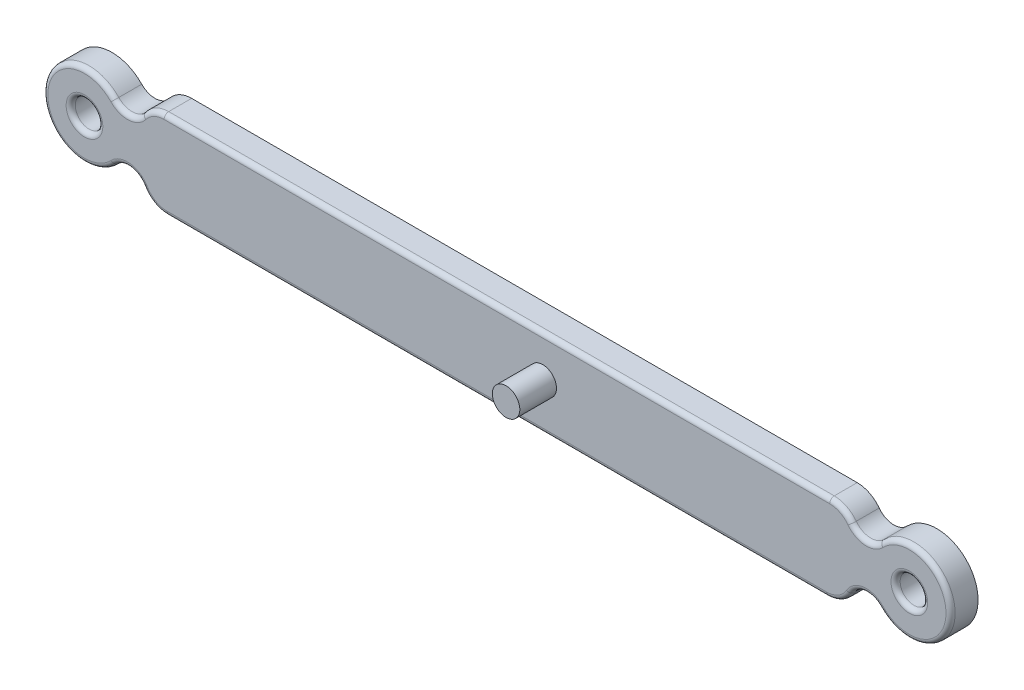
ISO-10303-21;
HEADER;
FILE_DESCRIPTION(('STEP AP214'),'2;1');
FILE_NAME('part.step','',(''),(''),'','','');
FILE_SCHEMA(('AUTOMOTIVE_DESIGN { 1 0 10303 214 1 1 1 1 }'));
ENDSEC;
DATA;
#1=APPLICATION_CONTEXT('core data for automotive mechanical design processes');
#2=APPLICATION_PROTOCOL_DEFINITION('international standard','automotive_design',2000,#1);
#3=PRODUCT_CONTEXT('',#1,'mechanical');
#4=PRODUCT('Part','Part','',(#3));
#5=PRODUCT_RELATED_PRODUCT_CATEGORY('part','',(#4));
#6=PRODUCT_DEFINITION_FORMATION('','',#4);
#7=PRODUCT_DEFINITION_CONTEXT('part definition',#1,'design');
#8=PRODUCT_DEFINITION('design','',#6,#7);
#9=PRODUCT_DEFINITION_SHAPE('','',#8);
#10=(LENGTH_UNIT() NAMED_UNIT(*) SI_UNIT(.MILLI.,.METRE.));
#11=(NAMED_UNIT(*) PLANE_ANGLE_UNIT() SI_UNIT($,.RADIAN.));
#12=(NAMED_UNIT(*) SI_UNIT($,.STERADIAN.) SOLID_ANGLE_UNIT());
#13=UNCERTAINTY_MEASURE_WITH_UNIT(LENGTH_MEASURE(1.E-05),#10,'distance_accuracy_value','');
#14=(GEOMETRIC_REPRESENTATION_CONTEXT(3) GLOBAL_UNCERTAINTY_ASSIGNED_CONTEXT((#13)) GLOBAL_UNIT_ASSIGNED_CONTEXT((#10,
#11,#12)) REPRESENTATION_CONTEXT('',''));
#15=CARTESIAN_POINT('',(0.,0.,0.));
#16=DIRECTION('',(0.,0.,1.));
#17=DIRECTION('',(1.,0.,0.));
#18=AXIS2_PLACEMENT_3D('',#15,#16,#17);
#19=CARTESIAN_POINT('',(86.9041575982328,14.9999999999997,30.));
#20=DIRECTION('',(0.,0.,-1.));
#21=DIRECTION('',(-1.,0.,0.));
#22=AXIS2_PLACEMENT_3D('',#19,#20,#21);
#23=PLANE('',#22);
#24=CARTESIAN_POINT('',(499.999999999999,-4.44089209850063E-13,30.));
#25=DIRECTION('',(0.,0.,-1.));
#26=DIRECTION('',(-1.,0.,0.));
#27=AXIS2_PLACEMENT_3D('',#24,#25,#26);
#28=CIRCLE('',#27,15.);
#29=CARTESIAN_POINT('',(514.999999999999,-4.43924140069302E-13,30.));
#30=VERTEX_POINT('',#29);
#31=EDGE_CURVE('E647',#30,#30,#28,.T.);
#32=ORIENTED_EDGE('',*,*,#31,.T.);
#33=EDGE_LOOP('',(#32));
#34=FACE_BOUND('',#33,.T.);
#35=CARTESIAN_POINT('',(899.999999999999,0.,30.));
#36=DIRECTION('',(0.,0.,-1.));
#37=DIRECTION('',(-1.,0.,0.));
#38=AXIS2_PLACEMENT_3D('',#35,#36,#37);
#39=CIRCLE('',#38,20.);
#40=CARTESIAN_POINT('',(879.999999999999,0.,30.));
#41=VERTEX_POINT('',#40);
#42=EDGE_CURVE('E264',#41,#41,#39,.T.);
#43=ORIENTED_EDGE('',*,*,#42,.T.);
#44=EDGE_LOOP('',(#43));
#45=FACE_BOUND('',#44,.T.);
#46=CARTESIAN_POINT('',(813.095842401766,14.9999999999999,30.));
#47=DIRECTION('',(0.,0.,-1.));
#48=DIRECTION('',(-1.,0.,0.));
#49=AXIS2_PLACEMENT_3D('',#46,#47,#48);
#50=CIRCLE('',#49,25.);
#51=CARTESIAN_POINT('',(833.095842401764,29.9999999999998,30.));
#52=VERTEX_POINT('',#51);
#53=CARTESIAN_POINT('',(813.095842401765,39.9999999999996,30.));
#54=VERTEX_POINT('',#53);
#55=EDGE_CURVE('E259',#52,#54,#50,.F.);
#56=ORIENTED_EDGE('',*,*,#55,.T.);
#57=DIRECTION('',(-1.,0.,0.));
#58=VECTOR('',#57,1.);
#59=CARTESIAN_POINT('',(86.9041575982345,39.9999999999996,30.));
#60=LINE('',#59,#58);
#61=CARTESIAN_POINT('',(86.9041575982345,39.9999999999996,30.));
#62=VERTEX_POINT('',#61);
#63=EDGE_CURVE('E261',#54,#62,#60,.T.);
#64=ORIENTED_EDGE('',*,*,#63,.T.);
#65=CARTESIAN_POINT('',(86.9041575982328,14.9999999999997,30.));
#66=DIRECTION('',(0.,0.,-1.));
#67=DIRECTION('',(-1.,0.,0.));
#68=AXIS2_PLACEMENT_3D('',#65,#66,#67);
#69=CIRCLE('',#68,25.);
#70=CARTESIAN_POINT('',(66.9041575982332,29.9999999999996,30.));
#71=VERTEX_POINT('',#70);
#72=EDGE_CURVE('E239',#62,#71,#69,.F.);
#73=ORIENTED_EDGE('',*,*,#72,.T.);
#74=CARTESIAN_POINT('',(46.9041575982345,44.9999999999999,30.));
#75=DIRECTION('',(0.,0.,-1.));
#76=DIRECTION('',(-1.,0.,0.));
#77=AXIS2_PLACEMENT_3D('',#74,#75,#76);
#78=CIRCLE('',#77,25.);
#79=CARTESIAN_POINT('',(28.8640969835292,27.6923076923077,30.));
#80=VERTEX_POINT('',#79);
#81=EDGE_CURVE('E241',#71,#80,#78,.T.);
#82=ORIENTED_EDGE('',*,*,#81,.T.);
#83=CARTESIAN_POINT('',(0.,0.,30.));
#84=DIRECTION('',(0.,0.,-1.));
#85=DIRECTION('',(-1.,0.,0.));
#86=AXIS2_PLACEMENT_3D('',#83,#84,#85);
#87=CIRCLE('',#86,40.);
#88=CARTESIAN_POINT('',(28.8640969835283,-27.6923076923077,30.));
#89=VERTEX_POINT('',#88);
#90=EDGE_CURVE('E243',#80,#89,#87,.F.);
#91=ORIENTED_EDGE('',*,*,#90,.T.);
#92=CARTESIAN_POINT('',(46.9041575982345,-44.9999999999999,30.));
#93=DIRECTION('',(0.,0.,-1.));
#94=DIRECTION('',(-1.,0.,0.));
#95=AXIS2_PLACEMENT_3D('',#92,#93,#94);
#96=CIRCLE('',#95,25.);
#97=CARTESIAN_POINT('',(68.5547926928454,-32.5,30.));
#98=VERTEX_POINT('',#97);
#99=EDGE_CURVE('E245',#89,#98,#96,.T.);
#100=ORIENTED_EDGE('',*,*,#99,.T.);
#101=CARTESIAN_POINT('',(90.2054277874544,-20.0000000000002,30.));
#102=DIRECTION('',(0.,0.,-1.));
#103=DIRECTION('',(-1.,0.,0.));
#104=AXIS2_PLACEMENT_3D('',#101,#102,#103);
#105=CIRCLE('',#104,25.);
#106=CARTESIAN_POINT('',(90.2054277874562,-45.0000000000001,30.));
#107=VERTEX_POINT('',#106);
#108=EDGE_CURVE('E247',#98,#107,#105,.F.);
#109=ORIENTED_EDGE('',*,*,#108,.T.);
#110=DIRECTION('',(1.,0.,0.));
#111=VECTOR('',#110,1.);
#112=CARTESIAN_POINT('',(86.9041575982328,-45.0000000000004,30.));
#113=LINE('',#112,#111);
#114=CARTESIAN_POINT('',(809.794572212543,-45.0000000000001,30.));
#115=VERTEX_POINT('',#114);
#116=EDGE_CURVE('E249',#107,#115,#113,.T.);
#117=ORIENTED_EDGE('',*,*,#116,.T.);
#118=CARTESIAN_POINT('',(809.794572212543,-20.,30.));
#119=DIRECTION('',(0.,0.,-1.));
#120=DIRECTION('',(-1.,0.,0.));
#121=AXIS2_PLACEMENT_3D('',#118,#119,#120);
#122=CIRCLE('',#121,25.);
#123=CARTESIAN_POINT('',(831.445207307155,-32.5,30.));
#124=VERTEX_POINT('',#123);
#125=EDGE_CURVE('E251',#115,#124,#122,.F.);
#126=ORIENTED_EDGE('',*,*,#125,.T.);
#127=CARTESIAN_POINT('',(853.095842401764,-45.0000000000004,30.));
#128=DIRECTION('',(0.,0.,-1.));
#129=DIRECTION('',(-1.,0.,0.));
#130=AXIS2_PLACEMENT_3D('',#127,#128,#129);
#131=CIRCLE('',#130,25.);
#132=CARTESIAN_POINT('',(871.135903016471,-27.6923076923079,30.));
#133=VERTEX_POINT('',#132);
#134=EDGE_CURVE('E253',#124,#133,#131,.T.);
#135=ORIENTED_EDGE('',*,*,#134,.T.);
#136=CARTESIAN_POINT('',(899.999999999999,0.,30.));
#137=DIRECTION('',(0.,0.,-1.));
#138=DIRECTION('',(-1.,0.,0.));
#139=AXIS2_PLACEMENT_3D('',#136,#137,#138);
#140=CIRCLE('',#139,40.);
#141=CARTESIAN_POINT('',(871.135903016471,27.6923076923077,30.));
#142=VERTEX_POINT('',#141);
#143=EDGE_CURVE('E255',#133,#142,#140,.F.);
#144=ORIENTED_EDGE('',*,*,#143,.T.);
#145=CARTESIAN_POINT('',(853.095842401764,44.9999999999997,30.));
#146=DIRECTION('',(0.,0.,-1.));
#147=DIRECTION('',(-1.,0.,0.));
#148=AXIS2_PLACEMENT_3D('',#145,#146,#147);
#149=CIRCLE('',#148,24.9999999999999);
#150=EDGE_CURVE('E257',#142,#52,#149,.T.);
#151=ORIENTED_EDGE('',*,*,#150,.T.);
#152=EDGE_LOOP('',(#56,#64,#73,#82,#91,#100,#109,#117,#126,#135,#144,#151));
#153=FACE_BOUND('',#152,.T.);
#154=CARTESIAN_POINT('',(0.,0.,30.));
#155=DIRECTION('',(0.,0.,-1.));
#156=DIRECTION('',(-1.,0.,0.));
#157=AXIS2_PLACEMENT_3D('',#154,#155,#156);
#158=CIRCLE('',#157,20.);
#159=CARTESIAN_POINT('',(-20.,0.,30.));
#160=VERTEX_POINT('',#159);
#161=EDGE_CURVE('E236',#160,#160,#158,.T.);
#162=ORIENTED_EDGE('',*,*,#161,.T.);
#163=EDGE_LOOP('',(#162));
#164=FACE_BOUND('',#163,.T.);
#165=ADVANCED_FACE('F32',(#34,#45,#153,#164),#23,.F.);
#166=CARTESIAN_POINT('',(86.9041575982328,14.9999999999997,0.));
#167=DIRECTION('',(0.,0.,-1.));
#168=DIRECTION('',(-1.,0.,0.));
#169=AXIS2_PLACEMENT_3D('',#166,#167,#168);
#170=PLANE('',#169);
#171=CARTESIAN_POINT('',(499.999999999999,-4.44089209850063E-13,0.));
#172=DIRECTION('',(0.,0.,-1.));
#173=DIRECTION('',(-1.,0.,0.));
#174=AXIS2_PLACEMENT_3D('',#171,#172,#173);
#175=CIRCLE('',#174,15.);
#176=CARTESIAN_POINT('',(514.999999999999,-4.43924140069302E-13,0.));
#177=VERTEX_POINT('',#176);
#178=EDGE_CURVE('E293',#177,#177,#175,.T.);
#179=ORIENTED_EDGE('',*,*,#178,.F.);
#180=EDGE_LOOP('',(#179));
#181=FACE_BOUND('',#180,.T.);
#182=CARTESIAN_POINT('',(0.,0.,0.));
#183=DIRECTION('',(0.,0.,1.));
#184=DIRECTION('',(1.,0.,0.));
#185=AXIS2_PLACEMENT_3D('',#182,#183,#184);
#186=CIRCLE('',#185,15.);
#187=CARTESIAN_POINT('',(-15.,0.,0.));
#188=VERTEX_POINT('',#187);
#189=EDGE_CURVE('E180',#188,#188,#186,.T.);
#190=ORIENTED_EDGE('',*,*,#189,.T.);
#191=EDGE_LOOP('',(#190));
#192=FACE_BOUND('',#191,.T.);
#193=CARTESIAN_POINT('',(86.9041575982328,14.9999999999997,0.));
#194=DIRECTION('',(0.,0.,1.));
#195=DIRECTION('',(-1.,0.,0.));
#196=AXIS2_PLACEMENT_3D('',#193,#194,#195);
#197=CIRCLE('',#196,30.);
#198=CARTESIAN_POINT('',(86.9041575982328,44.9999999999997,0.));
#199=VERTEX_POINT('',#198);
#200=CARTESIAN_POINT('',(62.9041575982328,32.9999999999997,0.));
#201=VERTEX_POINT('',#200);
#202=EDGE_CURVE('E172',#199,#201,#197,.T.);
#203=ORIENTED_EDGE('',*,*,#202,.F.);
#204=DIRECTION('',(-1.,0.,0.));
#205=VECTOR('',#204,1.);
#206=CARTESIAN_POINT('',(86.9041575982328,44.9999999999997,0.));
#207=LINE('',#206,#205);
#208=CARTESIAN_POINT('',(813.095842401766,44.9999999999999,0.));
#209=VERTEX_POINT('',#208);
#210=EDGE_CURVE('E212',#209,#199,#207,.T.);
#211=ORIENTED_EDGE('',*,*,#210,.F.);
#212=CARTESIAN_POINT('',(813.095842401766,14.9999999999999,0.));
#213=DIRECTION('',(0.,0.,1.));
#214=DIRECTION('',(1.,0.,0.));
#215=AXIS2_PLACEMENT_3D('',#212,#213,#214);
#216=CIRCLE('',#215,30.);
#217=CARTESIAN_POINT('',(837.095842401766,32.9999999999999,0.));
#218=VERTEX_POINT('',#217);
#219=EDGE_CURVE('E209',#218,#209,#216,.T.);
#220=ORIENTED_EDGE('',*,*,#219,.F.);
#221=CARTESIAN_POINT('',(853.095842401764,44.9999999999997,0.));
#222=DIRECTION('',(0.,0.,-1.));
#223=DIRECTION('',(1.,0.,0.));
#224=AXIS2_PLACEMENT_3D('',#221,#222,#223);
#225=CIRCLE('',#224,19.9999999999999);
#226=CARTESIAN_POINT('',(867.52789089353,31.1538461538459,0.));
#227=VERTEX_POINT('',#226);
#228=EDGE_CURVE('E206',#227,#218,#225,.T.);
#229=ORIENTED_EDGE('',*,*,#228,.F.);
#230=CARTESIAN_POINT('',(899.999999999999,0.,0.));
#231=DIRECTION('',(0.,0.,1.));
#232=DIRECTION('',(1.,0.,0.));
#233=AXIS2_PLACEMENT_3D('',#230,#231,#232);
#234=CIRCLE('',#233,45.);
#235=CARTESIAN_POINT('',(867.527890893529,-31.1538461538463,0.));
#236=VERTEX_POINT('',#235);
#237=EDGE_CURVE('E203',#236,#227,#234,.T.);
#238=ORIENTED_EDGE('',*,*,#237,.F.);
#239=CARTESIAN_POINT('',(853.095842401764,-45.0000000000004,0.));
#240=DIRECTION('',(0.,0.,-1.));
#241=DIRECTION('',(1.,0.,0.));
#242=AXIS2_PLACEMENT_3D('',#239,#240,#241);
#243=CIRCLE('',#242,20.);
#244=CARTESIAN_POINT('',(835.775334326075,-35.0000000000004,0.));
#245=VERTEX_POINT('',#244);
#246=EDGE_CURVE('E200',#245,#236,#243,.T.);
#247=ORIENTED_EDGE('',*,*,#246,.F.);
#248=CARTESIAN_POINT('',(809.794572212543,-20.,0.));
#249=DIRECTION('',(0.,0.,1.));
#250=DIRECTION('',(1.,0.,0.));
#251=AXIS2_PLACEMENT_3D('',#248,#249,#250);
#252=CIRCLE('',#251,30.);
#253=CARTESIAN_POINT('',(809.794572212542,-50.0000000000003,0.));
#254=VERTEX_POINT('',#253);
#255=EDGE_CURVE('E197',#254,#245,#252,.T.);
#256=ORIENTED_EDGE('',*,*,#255,.F.);
#257=DIRECTION('',(1.,0.,0.));
#258=VECTOR('',#257,1.);
#259=CARTESIAN_POINT('',(90.2054277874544,-50.,0.));
#260=LINE('',#259,#258);
#261=CARTESIAN_POINT('',(90.2054277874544,-50.,0.));
#262=VERTEX_POINT('',#261);
#263=EDGE_CURVE('E194',#262,#254,#260,.T.);
#264=ORIENTED_EDGE('',*,*,#263,.F.);
#265=CARTESIAN_POINT('',(90.2054277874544,-20.0000000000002,0.));
#266=DIRECTION('',(0.,0.,1.));
#267=DIRECTION('',(1.,0.,0.));
#268=AXIS2_PLACEMENT_3D('',#265,#266,#267);
#269=CIRCLE('',#268,30.);
#270=CARTESIAN_POINT('',(64.2246656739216,-35.0000000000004,0.));
#271=VERTEX_POINT('',#270);
#272=EDGE_CURVE('E191',#271,#262,#269,.T.);
#273=ORIENTED_EDGE('',*,*,#272,.F.);
#274=CARTESIAN_POINT('',(46.9041575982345,-44.9999999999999,0.));
#275=DIRECTION('',(0.,0.,-1.));
#276=DIRECTION('',(1.,0.,0.));
#277=AXIS2_PLACEMENT_3D('',#274,#275,#276);
#278=CIRCLE('',#277,20.);
#279=CARTESIAN_POINT('',(32.4721091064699,-31.1538461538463,0.));
#280=VERTEX_POINT('',#279);
#281=EDGE_CURVE('E188',#280,#271,#278,.T.);
#282=ORIENTED_EDGE('',*,*,#281,.F.);
#283=CARTESIAN_POINT('',(0.,0.,0.));
#284=DIRECTION('',(0.,0.,1.));
#285=DIRECTION('',(1.,0.,0.));
#286=AXIS2_PLACEMENT_3D('',#283,#284,#285);
#287=CIRCLE('',#286,45.);
#288=CARTESIAN_POINT('',(32.4721091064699,31.1538461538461,0.));
#289=VERTEX_POINT('',#288);
#290=EDGE_CURVE('E175',#289,#280,#287,.T.);
#291=ORIENTED_EDGE('',*,*,#290,.F.);
#292=CARTESIAN_POINT('',(46.9041575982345,44.9999999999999,0.));
#293=DIRECTION('',(0.,0.,-1.));
#294=DIRECTION('',(1.,0.,0.));
#295=AXIS2_PLACEMENT_3D('',#292,#293,#294);
#296=CIRCLE('',#295,20.);
#297=EDGE_CURVE('E159',#201,#289,#296,.T.);
#298=ORIENTED_EDGE('',*,*,#297,.F.);
#299=EDGE_LOOP('',(#203,#211,#220,#229,#238,#247,#256,#264,#273,#282,#291,#298));
#300=FACE_BOUND('',#299,.T.);
#301=CARTESIAN_POINT('',(899.999999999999,0.,0.));
#302=DIRECTION('',(0.,0.,1.));
#303=DIRECTION('',(1.,0.,0.));
#304=AXIS2_PLACEMENT_3D('',#301,#302,#303);
#305=CIRCLE('',#304,15.);
#306=CARTESIAN_POINT('',(884.999999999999,0.,0.));
#307=VERTEX_POINT('',#306);
#308=EDGE_CURVE('E183',#307,#307,#305,.T.);
#309=ORIENTED_EDGE('',*,*,#308,.T.);
#310=EDGE_LOOP('',(#309));
#311=FACE_BOUND('',#310,.T.);
#312=ADVANCED_FACE('F169',(#181,#192,#300,#311),#170,.T.);
#313=CARTESIAN_POINT('',(86.9041575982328,14.9999999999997,30.));
#314=DIRECTION('',(0.,0.,-1.));
#315=DIRECTION('',(-1.,0.,0.));
#316=AXIS2_PLACEMENT_3D('',#313,#314,#315);
#317=CYLINDRICAL_SURFACE('',#316,30.);
#318=DIRECTION('',(0.,0.,-1.));
#319=VECTOR('',#318,1.);
#320=CARTESIAN_POINT('',(62.9041575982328,32.9999999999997,30.));
#321=LINE('',#320,#319);
#322=CARTESIAN_POINT('',(62.9041575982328,32.9999999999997,25.));
#323=VERTEX_POINT('',#322);
#324=EDGE_CURVE('E156',#323,#201,#321,.T.);
#325=ORIENTED_EDGE('',*,*,#324,.F.);
#326=CARTESIAN_POINT('',(86.9041575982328,14.9999999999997,25.));
#327=DIRECTION('',(0.,0.,-1.));
#328=DIRECTION('',(-1.,0.,0.));
#329=AXIS2_PLACEMENT_3D('',#326,#327,#328);
#330=CIRCLE('',#329,30.);
#331=CARTESIAN_POINT('',(86.9041575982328,44.9999999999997,25.));
#332=VERTEX_POINT('',#331);
#333=EDGE_CURVE('E288',#323,#332,#330,.T.);
#334=ORIENTED_EDGE('',*,*,#333,.T.);
#335=DIRECTION('',(0.,0.,-1.));
#336=VECTOR('',#335,1.);
#337=CARTESIAN_POINT('',(86.9041575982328,44.9999999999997,30.));
#338=LINE('',#337,#336);
#339=EDGE_CURVE('E178',#332,#199,#338,.T.);
#340=ORIENTED_EDGE('',*,*,#339,.T.);
#341=ORIENTED_EDGE('',*,*,#202,.T.);
#342=EDGE_LOOP('',(#325,#334,#340,#341));
#343=FACE_BOUND('',#342,.T.);
#344=ADVANCED_FACE('F34',(#343),#317,.T.);
#345=CARTESIAN_POINT('',(46.9041575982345,44.9999999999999,30.));
#346=DIRECTION('',(0.,0.,-1.));
#347=DIRECTION('',(-1.,0.,0.));
#348=AXIS2_PLACEMENT_3D('',#345,#346,#347);
#349=CYLINDRICAL_SURFACE('',#348,20.);
#350=DIRECTION('',(0.,0.,-1.));
#351=VECTOR('',#350,1.);
#352=CARTESIAN_POINT('',(32.4721091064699,31.1538461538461,30.));
#353=LINE('',#352,#351);
#354=CARTESIAN_POINT('',(32.4721091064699,31.1538461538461,25.));
#355=VERTEX_POINT('',#354);
#356=EDGE_CURVE('E165',#355,#289,#353,.T.);
#357=ORIENTED_EDGE('',*,*,#356,.F.);
#358=CARTESIAN_POINT('',(46.9041575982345,44.9999999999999,25.));
#359=DIRECTION('',(0.,0.,-1.));
#360=DIRECTION('',(-1.,0.,0.));
#361=AXIS2_PLACEMENT_3D('',#358,#359,#360);
#362=CIRCLE('',#361,20.);
#363=EDGE_CURVE('E47',#355,#323,#362,.F.);
#364=ORIENTED_EDGE('',*,*,#363,.T.);
#365=ORIENTED_EDGE('',*,*,#324,.T.);
#366=ORIENTED_EDGE('',*,*,#297,.T.);
#367=EDGE_LOOP('',(#357,#364,#365,#366));
#368=FACE_BOUND('',#367,.T.);
#369=ADVANCED_FACE('F158',(#368),#349,.F.);
#370=CARTESIAN_POINT('',(0.,0.,30.));
#371=DIRECTION('',(0.,0.,-1.));
#372=DIRECTION('',(-1.,0.,0.));
#373=AXIS2_PLACEMENT_3D('',#370,#371,#372);
#374=CYLINDRICAL_SURFACE('',#373,45.);
#375=DIRECTION('',(0.,0.,-1.));
#376=VECTOR('',#375,1.);
#377=CARTESIAN_POINT('',(32.4721091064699,-31.1538461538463,30.));
#378=LINE('',#377,#376);
#379=CARTESIAN_POINT('',(32.4721091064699,-31.1538461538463,25.));
#380=VERTEX_POINT('',#379);
#381=EDGE_CURVE('E231',#380,#280,#378,.T.);
#382=ORIENTED_EDGE('',*,*,#381,.F.);
#383=CARTESIAN_POINT('',(0.,0.,25.));
#384=DIRECTION('',(0.,0.,-1.));
#385=DIRECTION('',(-1.,0.,0.));
#386=AXIS2_PLACEMENT_3D('',#383,#384,#385);
#387=CIRCLE('',#386,45.);
#388=EDGE_CURVE('E55',#380,#355,#387,.T.);
#389=ORIENTED_EDGE('',*,*,#388,.T.);
#390=ORIENTED_EDGE('',*,*,#356,.T.);
#391=ORIENTED_EDGE('',*,*,#290,.T.);
#392=EDGE_LOOP('',(#382,#389,#390,#391));
#393=FACE_BOUND('',#392,.T.);
#394=ADVANCED_FACE('F361',(#393),#374,.T.);
#395=CARTESIAN_POINT('',(46.9041575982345,-44.9999999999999,30.));
#396=DIRECTION('',(0.,0.,-1.));
#397=DIRECTION('',(-1.,0.,0.));
#398=AXIS2_PLACEMENT_3D('',#395,#396,#397);
#399=CYLINDRICAL_SURFACE('',#398,20.);
#400=DIRECTION('',(0.,0.,-1.));
#401=VECTOR('',#400,1.);
#402=CARTESIAN_POINT('',(64.2246656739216,-35.0000000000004,30.));
#403=LINE('',#402,#401);
#404=CARTESIAN_POINT('',(64.2246656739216,-35.0000000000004,25.));
#405=VERTEX_POINT('',#404);
#406=EDGE_CURVE('E229',#405,#271,#403,.T.);
#407=ORIENTED_EDGE('',*,*,#406,.F.);
#408=CARTESIAN_POINT('',(46.9041575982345,-44.9999999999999,25.));
#409=DIRECTION('',(0.,0.,-1.));
#410=DIRECTION('',(-1.,0.,0.));
#411=AXIS2_PLACEMENT_3D('',#408,#409,#410);
#412=CIRCLE('',#411,20.);
#413=EDGE_CURVE('E284',#405,#380,#412,.F.);
#414=ORIENTED_EDGE('',*,*,#413,.T.);
#415=ORIENTED_EDGE('',*,*,#381,.T.);
#416=ORIENTED_EDGE('',*,*,#281,.T.);
#417=EDGE_LOOP('',(#407,#414,#415,#416));
#418=FACE_BOUND('',#417,.T.);
#419=ADVANCED_FACE('F357',(#418),#399,.F.);
#420=CARTESIAN_POINT('',(90.2054277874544,-20.0000000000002,30.));
#421=DIRECTION('',(0.,0.,-1.));
#422=DIRECTION('',(-1.,0.,0.));
#423=AXIS2_PLACEMENT_3D('',#420,#421,#422);
#424=CYLINDRICAL_SURFACE('',#423,30.);
#425=DIRECTION('',(0.,0.,-1.));
#426=VECTOR('',#425,1.);
#427=CARTESIAN_POINT('',(90.2054277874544,-50.,30.));
#428=LINE('',#427,#426);
#429=CARTESIAN_POINT('',(90.2054277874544,-50.,25.));
#430=VERTEX_POINT('',#429);
#431=EDGE_CURVE('E227',#430,#262,#428,.T.);
#432=ORIENTED_EDGE('',*,*,#431,.F.);
#433=CARTESIAN_POINT('',(90.2054277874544,-20.0000000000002,25.));
#434=DIRECTION('',(0.,0.,-1.));
#435=DIRECTION('',(-1.,0.,0.));
#436=AXIS2_PLACEMENT_3D('',#433,#434,#435);
#437=CIRCLE('',#436,30.);
#438=EDGE_CURVE('E282',#430,#405,#437,.T.);
#439=ORIENTED_EDGE('',*,*,#438,.T.);
#440=ORIENTED_EDGE('',*,*,#406,.T.);
#441=ORIENTED_EDGE('',*,*,#272,.T.);
#442=EDGE_LOOP('',(#432,#439,#440,#441));
#443=FACE_BOUND('',#442,.T.);
#444=ADVANCED_FACE('F353',(#443),#424,.T.);
#445=CARTESIAN_POINT('',(90.2054277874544,-50.,30.));
#446=DIRECTION('',(0.,1.,0.));
#447=DIRECTION('',(-1.,0.,0.));
#448=AXIS2_PLACEMENT_3D('',#445,#446,#447);
#449=PLANE('',#448);
#450=DIRECTION('',(0.,0.,-1.));
#451=VECTOR('',#450,1.);
#452=CARTESIAN_POINT('',(809.794572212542,-50.0000000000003,30.));
#453=LINE('',#452,#451);
#454=CARTESIAN_POINT('',(809.794572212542,-50.0000000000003,25.));
#455=VERTEX_POINT('',#454);
#456=EDGE_CURVE('E225',#455,#254,#453,.T.);
#457=ORIENTED_EDGE('',*,*,#456,.F.);
#458=DIRECTION('',(1.,0.,0.));
#459=VECTOR('',#458,1.);
#460=CARTESIAN_POINT('',(90.2054277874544,-50.,25.));
#461=LINE('',#460,#459);
#462=EDGE_CURVE('E280',#455,#430,#461,.F.);
#463=ORIENTED_EDGE('',*,*,#462,.T.);
#464=ORIENTED_EDGE('',*,*,#431,.T.);
#465=ORIENTED_EDGE('',*,*,#263,.T.);
#466=EDGE_LOOP('',(#457,#463,#464,#465));
#467=FACE_BOUND('',#466,.T.);
#468=ADVANCED_FACE('F349',(#467),#449,.F.);
#469=CARTESIAN_POINT('',(809.794572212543,-20.,30.));
#470=DIRECTION('',(0.,0.,-1.));
#471=DIRECTION('',(-1.,0.,0.));
#472=AXIS2_PLACEMENT_3D('',#469,#470,#471);
#473=CYLINDRICAL_SURFACE('',#472,30.);
#474=DIRECTION('',(0.,0.,-1.));
#475=VECTOR('',#474,1.);
#476=CARTESIAN_POINT('',(835.775334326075,-35.0000000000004,30.));
#477=LINE('',#476,#475);
#478=CARTESIAN_POINT('',(835.775334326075,-35.0000000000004,25.));
#479=VERTEX_POINT('',#478);
#480=EDGE_CURVE('E223',#479,#245,#477,.T.);
#481=ORIENTED_EDGE('',*,*,#480,.F.);
#482=CARTESIAN_POINT('',(809.794572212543,-20.,25.));
#483=DIRECTION('',(0.,0.,-1.));
#484=DIRECTION('',(-1.,0.,0.));
#485=AXIS2_PLACEMENT_3D('',#482,#483,#484);
#486=CIRCLE('',#485,30.);
#487=EDGE_CURVE('E278',#479,#455,#486,.T.);
#488=ORIENTED_EDGE('',*,*,#487,.T.);
#489=ORIENTED_EDGE('',*,*,#456,.T.);
#490=ORIENTED_EDGE('',*,*,#255,.T.);
#491=EDGE_LOOP('',(#481,#488,#489,#490));
#492=FACE_BOUND('',#491,.T.);
#493=ADVANCED_FACE('F345',(#492),#473,.T.);
#494=CARTESIAN_POINT('',(853.095842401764,-45.0000000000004,30.));
#495=DIRECTION('',(0.,0.,-1.));
#496=DIRECTION('',(-1.,0.,0.));
#497=AXIS2_PLACEMENT_3D('',#494,#495,#496);
#498=CYLINDRICAL_SURFACE('',#497,20.);
#499=DIRECTION('',(0.,0.,-1.));
#500=VECTOR('',#499,1.);
#501=CARTESIAN_POINT('',(867.527890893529,-31.1538461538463,30.));
#502=LINE('',#501,#500);
#503=CARTESIAN_POINT('',(867.527890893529,-31.1538461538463,25.));
#504=VERTEX_POINT('',#503);
#505=EDGE_CURVE('E221',#504,#236,#502,.T.);
#506=ORIENTED_EDGE('',*,*,#505,.F.);
#507=CARTESIAN_POINT('',(853.095842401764,-45.0000000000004,25.));
#508=DIRECTION('',(0.,0.,-1.));
#509=DIRECTION('',(-1.,0.,0.));
#510=AXIS2_PLACEMENT_3D('',#507,#508,#509);
#511=CIRCLE('',#510,20.);
#512=EDGE_CURVE('E276',#504,#479,#511,.F.);
#513=ORIENTED_EDGE('',*,*,#512,.T.);
#514=ORIENTED_EDGE('',*,*,#480,.T.);
#515=ORIENTED_EDGE('',*,*,#246,.T.);
#516=EDGE_LOOP('',(#506,#513,#514,#515));
#517=FACE_BOUND('',#516,.T.);
#518=ADVANCED_FACE('F341',(#517),#498,.F.);
#519=CARTESIAN_POINT('',(899.999999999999,0.,30.));
#520=DIRECTION('',(0.,0.,-1.));
#521=DIRECTION('',(-1.,0.,0.));
#522=AXIS2_PLACEMENT_3D('',#519,#520,#521);
#523=CYLINDRICAL_SURFACE('',#522,45.);
#524=DIRECTION('',(0.,0.,-1.));
#525=VECTOR('',#524,1.);
#526=CARTESIAN_POINT('',(867.52789089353,31.1538461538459,30.));
#527=LINE('',#526,#525);
#528=CARTESIAN_POINT('',(867.52789089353,31.1538461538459,25.));
#529=VERTEX_POINT('',#528);
#530=EDGE_CURVE('E219',#529,#227,#527,.T.);
#531=ORIENTED_EDGE('',*,*,#530,.F.);
#532=CARTESIAN_POINT('',(899.999999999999,0.,25.));
#533=DIRECTION('',(0.,0.,-1.));
#534=DIRECTION('',(-1.,0.,0.));
#535=AXIS2_PLACEMENT_3D('',#532,#533,#534);
#536=CIRCLE('',#535,45.);
#537=EDGE_CURVE('E274',#529,#504,#536,.T.);
#538=ORIENTED_EDGE('',*,*,#537,.T.);
#539=ORIENTED_EDGE('',*,*,#505,.T.);
#540=ORIENTED_EDGE('',*,*,#237,.T.);
#541=EDGE_LOOP('',(#531,#538,#539,#540));
#542=FACE_BOUND('',#541,.T.);
#543=ADVANCED_FACE('F337',(#542),#523,.T.);
#544=CARTESIAN_POINT('',(853.095842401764,44.9999999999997,30.));
#545=DIRECTION('',(0.,0.,-1.));
#546=DIRECTION('',(-1.,0.,0.));
#547=AXIS2_PLACEMENT_3D('',#544,#545,#546);
#548=CYLINDRICAL_SURFACE('',#547,19.9999999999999);
#549=DIRECTION('',(0.,0.,-1.));
#550=VECTOR('',#549,1.);
#551=CARTESIAN_POINT('',(837.095842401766,32.9999999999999,30.));
#552=LINE('',#551,#550);
#553=CARTESIAN_POINT('',(837.095842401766,32.9999999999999,25.));
#554=VERTEX_POINT('',#553);
#555=EDGE_CURVE('E217',#554,#218,#552,.T.);
#556=ORIENTED_EDGE('',*,*,#555,.F.);
#557=CARTESIAN_POINT('',(853.095842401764,44.9999999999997,25.));
#558=DIRECTION('',(0.,0.,-1.));
#559=DIRECTION('',(-1.,0.,0.));
#560=AXIS2_PLACEMENT_3D('',#557,#558,#559);
#561=CIRCLE('',#560,19.9999999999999);
#562=EDGE_CURVE('E272',#554,#529,#561,.F.);
#563=ORIENTED_EDGE('',*,*,#562,.T.);
#564=ORIENTED_EDGE('',*,*,#530,.T.);
#565=ORIENTED_EDGE('',*,*,#228,.T.);
#566=EDGE_LOOP('',(#556,#563,#564,#565));
#567=FACE_BOUND('',#566,.T.);
#568=ADVANCED_FACE('F333',(#567),#548,.F.);
#569=CARTESIAN_POINT('',(813.095842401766,14.9999999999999,30.));
#570=DIRECTION('',(0.,0.,-1.));
#571=DIRECTION('',(-1.,0.,0.));
#572=AXIS2_PLACEMENT_3D('',#569,#570,#571);
#573=CYLINDRICAL_SURFACE('',#572,30.);
#574=DIRECTION('',(0.,0.,-1.));
#575=VECTOR('',#574,1.);
#576=CARTESIAN_POINT('',(813.095842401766,44.9999999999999,30.));
#577=LINE('',#576,#575);
#578=CARTESIAN_POINT('',(813.095842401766,44.9999999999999,25.));
#579=VERTEX_POINT('',#578);
#580=EDGE_CURVE('E215',#579,#209,#577,.T.);
#581=ORIENTED_EDGE('',*,*,#580,.F.);
#582=CARTESIAN_POINT('',(813.095842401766,14.9999999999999,25.));
#583=DIRECTION('',(0.,0.,-1.));
#584=DIRECTION('',(-1.,0.,0.));
#585=AXIS2_PLACEMENT_3D('',#582,#583,#584);
#586=CIRCLE('',#585,30.);
#587=EDGE_CURVE('E270',#579,#554,#586,.T.);
#588=ORIENTED_EDGE('',*,*,#587,.T.);
#589=ORIENTED_EDGE('',*,*,#555,.T.);
#590=ORIENTED_EDGE('',*,*,#219,.T.);
#591=EDGE_LOOP('',(#581,#588,#589,#590));
#592=FACE_BOUND('',#591,.T.);
#593=ADVANCED_FACE('F329',(#592),#573,.T.);
#594=CARTESIAN_POINT('',(86.9041575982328,44.9999999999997,30.));
#595=DIRECTION('',(0.,-1.,0.));
#596=DIRECTION('',(1.,0.,0.));
#597=AXIS2_PLACEMENT_3D('',#594,#595,#596);
#598=PLANE('',#597);
#599=ORIENTED_EDGE('',*,*,#339,.F.);
#600=DIRECTION('',(-1.,0.,0.));
#601=VECTOR('',#600,1.);
#602=CARTESIAN_POINT('',(86.9041575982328,44.9999999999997,25.));
#603=LINE('',#602,#601);
#604=EDGE_CURVE('E267',#332,#579,#603,.F.);
#605=ORIENTED_EDGE('',*,*,#604,.T.);
#606=ORIENTED_EDGE('',*,*,#580,.T.);
#607=ORIENTED_EDGE('',*,*,#210,.T.);
#608=EDGE_LOOP('',(#599,#605,#606,#607));
#609=FACE_BOUND('',#608,.T.);
#610=ADVANCED_FACE('F325',(#609),#598,.F.);
#611=CARTESIAN_POINT('',(0.,0.,30.));
#612=DIRECTION('',(0.,0.,-1.));
#613=DIRECTION('',(-1.,0.,0.));
#614=AXIS2_PLACEMENT_3D('',#611,#612,#613);
#615=CYLINDRICAL_SURFACE('',#614,15.);
#616=CARTESIAN_POINT('',(0.,0.,25.));
#617=DIRECTION('',(0.,0.,-1.));
#618=DIRECTION('',(-1.,0.,0.));
#619=AXIS2_PLACEMENT_3D('',#616,#617,#618);
#620=CIRCLE('',#619,15.);
#621=CARTESIAN_POINT('',(-15.,0.,25.));
#622=VERTEX_POINT('',#621);
#623=EDGE_CURVE('E290',#622,#622,#620,.F.);
#624=CARTESIAN_POINT('',(-15.,0.,25.));
#625=CARTESIAN_POINT('',(-15.,0.,24.7395833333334));
#626=CARTESIAN_POINT('',(-15.,0.,24.4791666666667));
#627=CARTESIAN_POINT('',(-15.,0.,23.9583333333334));
#628=CARTESIAN_POINT('',(-15.,0.,23.6979166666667));
#629=CARTESIAN_POINT('',(-15.,0.,23.1770833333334));
#630=CARTESIAN_POINT('',(-15.,0.,22.9166666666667));
#631=CARTESIAN_POINT('',(-15.,0.,22.3958333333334));
#632=CARTESIAN_POINT('',(-15.,0.,22.1354166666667));
#633=CARTESIAN_POINT('',(-15.,0.,21.6145833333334));
#634=CARTESIAN_POINT('',(-15.,0.,21.3541666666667));
#635=CARTESIAN_POINT('',(-15.,0.,20.8333333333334));
#636=CARTESIAN_POINT('',(-15.,0.,20.5729166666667));
#637=CARTESIAN_POINT('',(-15.,0.,20.0520833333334));
#638=CARTESIAN_POINT('',(-15.,0.,19.7916666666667));
#639=CARTESIAN_POINT('',(-15.,0.,19.2708333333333));
#640=CARTESIAN_POINT('',(-15.,0.,19.0104166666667));
#641=CARTESIAN_POINT('',(-15.,0.,18.4895833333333));
#642=CARTESIAN_POINT('',(-15.,0.,18.2291666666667));
#643=CARTESIAN_POINT('',(-15.,0.,17.7083333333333));
#644=CARTESIAN_POINT('',(-15.,0.,17.4479166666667));
#645=CARTESIAN_POINT('',(-15.,0.,16.9270833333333));
#646=CARTESIAN_POINT('',(-15.,0.,16.6666666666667));
#647=CARTESIAN_POINT('',(-15.,0.,16.1458333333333));
#648=CARTESIAN_POINT('',(-15.,0.,15.8854166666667));
#649=CARTESIAN_POINT('',(-15.,0.,15.3645833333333));
#650=CARTESIAN_POINT('',(-15.,0.,15.1041666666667));
#651=CARTESIAN_POINT('',(-15.,0.,14.5833333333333));
#652=CARTESIAN_POINT('',(-15.,0.,14.3229166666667));
#653=CARTESIAN_POINT('',(-15.,0.,13.8020833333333));
#654=CARTESIAN_POINT('',(-15.,0.,13.5416666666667));
#655=CARTESIAN_POINT('',(-15.,0.,13.0208333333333));
#656=CARTESIAN_POINT('',(-15.,0.,12.7604166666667));
#657=CARTESIAN_POINT('',(-15.,0.,12.2395833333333));
#658=CARTESIAN_POINT('',(-15.,0.,11.9791666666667));
#659=CARTESIAN_POINT('',(-15.,0.,11.4583333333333));
#660=CARTESIAN_POINT('',(-15.,0.,11.1979166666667));
#661=CARTESIAN_POINT('',(-15.,0.,10.6770833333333));
#662=CARTESIAN_POINT('',(-15.,0.,10.4166666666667));
#663=CARTESIAN_POINT('',(-15.,0.,9.89583333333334));
#664=CARTESIAN_POINT('',(-15.,0.,9.63541666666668));
#665=CARTESIAN_POINT('',(-15.,0.,9.11458333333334));
#666=CARTESIAN_POINT('',(-15.,0.,8.85416666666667));
#667=CARTESIAN_POINT('',(-15.,0.,8.33333333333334));
#668=CARTESIAN_POINT('',(-15.,0.,8.07291666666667));
#669=CARTESIAN_POINT('',(-15.,0.,7.55208333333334));
#670=CARTESIAN_POINT('',(-15.,0.,7.29166666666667));
#671=CARTESIAN_POINT('',(-15.,0.,6.77083333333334));
#672=CARTESIAN_POINT('',(-15.,0.,6.51041666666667));
#673=CARTESIAN_POINT('',(-15.,0.,5.98958333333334));
#674=CARTESIAN_POINT('',(-15.,0.,5.72916666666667));
#675=CARTESIAN_POINT('',(-15.,0.,5.20833333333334));
#676=CARTESIAN_POINT('',(-15.,0.,4.94791666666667));
#677=CARTESIAN_POINT('',(-15.,0.,4.42708333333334));
#678=CARTESIAN_POINT('',(-15.,0.,4.16666666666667));
#679=CARTESIAN_POINT('',(-15.,0.,3.64583333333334));
#680=CARTESIAN_POINT('',(-15.,0.,3.38541666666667));
#681=CARTESIAN_POINT('',(-15.,0.,2.86458333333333));
#682=CARTESIAN_POINT('',(-15.,0.,2.60416666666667));
#683=CARTESIAN_POINT('',(-15.,0.,2.08333333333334));
#684=CARTESIAN_POINT('',(-15.,0.,1.82291666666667));
#685=CARTESIAN_POINT('',(-15.,0.,1.30208333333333));
#686=CARTESIAN_POINT('',(-15.,0.,1.04166666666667));
#687=CARTESIAN_POINT('',(-15.,0.,0.520833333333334));
#688=CARTESIAN_POINT('',(-15.,0.,0.260416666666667));
#689=CARTESIAN_POINT('',(-15.,0.,0.));
#690=B_SPLINE_CURVE_WITH_KNOTS('',3,(#624,#625,#626,#627,#628,#629,#630,#631,#632,#633,#634,
#635,#636,#637,#638,#639,#640,#641,#642,#643,#644,#645,#646,#647,#648,#649,#650,#651,#652,#653,
#654,#655,#656,#657,#658,#659,#660,#661,#662,#663,#664,#665,#666,#667,#668,#669,#670,#671,#672,
#673,#674,#675,#676,#677,#678,#679,#680,#681,#682,#683,#684,#685,#686,#687,#688,#689),
.UNSPECIFIED.,.F.,.F.,(4,2,2,2,2,2,2,2,2,2,2,2,2,2,2,2,2,2,2,2,2,2,2,2,2,2,2,2,2,2,2,2,4),(0.,
0.781250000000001,1.5625,2.34375,3.12500000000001,3.90625,4.68750000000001,5.46875,
6.25000000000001,7.03125000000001,7.81250000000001,8.59375000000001,9.37500000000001,10.15625,
10.9375,11.71875,12.5,13.28125,14.0625,14.84375,15.625,16.40625,17.1875,17.96875,18.75,19.53125,
20.3125,21.09375,21.875,22.65625,23.4375,24.21875,25.),.UNSPECIFIED.);
#691=EDGE_CURVE('BSEAM328',#622,#188,#690,.T.);
#692=ORIENTED_EDGE('',*,*,#623,.T.);
#693=ORIENTED_EDGE('',*,*,#189,.F.);
#694=ORIENTED_EDGE('',*,*,#691,.T.);
#695=ORIENTED_EDGE('',*,*,#691,.F.);
#696=EDGE_LOOP('',(#692,#694,#693,#695));
#697=FACE_BOUND('',#696,.T.);
#698=ADVANCED_FACE('F328',(#697),#615,.F.);
#699=CARTESIAN_POINT('',(899.999999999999,0.,30.));
#700=DIRECTION('',(0.,0.,-1.));
#701=DIRECTION('',(-1.,0.,0.));
#702=AXIS2_PLACEMENT_3D('',#699,#700,#701);
#703=CYLINDRICAL_SURFACE('',#702,15.);
#704=CARTESIAN_POINT('',(899.999999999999,0.,25.));
#705=DIRECTION('',(0.,0.,-1.));
#706=DIRECTION('',(-1.,0.,0.));
#707=AXIS2_PLACEMENT_3D('',#704,#705,#706);
#708=CIRCLE('',#707,15.);
#709=CARTESIAN_POINT('',(884.999999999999,0.,25.));
#710=VERTEX_POINT('',#709);
#711=EDGE_CURVE('E164',#710,#710,#708,.F.);
#712=CARTESIAN_POINT('',(884.999999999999,0.,25.));
#713=CARTESIAN_POINT('',(884.999999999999,0.,24.7395833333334));
#714=CARTESIAN_POINT('',(884.999999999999,0.,24.4791666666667));
#715=CARTESIAN_POINT('',(884.999999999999,0.,23.9583333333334));
#716=CARTESIAN_POINT('',(884.999999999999,0.,23.6979166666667));
#717=CARTESIAN_POINT('',(884.999999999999,0.,23.1770833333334));
#718=CARTESIAN_POINT('',(884.999999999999,0.,22.9166666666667));
#719=CARTESIAN_POINT('',(884.999999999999,0.,22.3958333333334));
#720=CARTESIAN_POINT('',(884.999999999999,0.,22.1354166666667));
#721=CARTESIAN_POINT('',(884.999999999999,0.,21.6145833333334));
#722=CARTESIAN_POINT('',(884.999999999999,0.,21.3541666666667));
#723=CARTESIAN_POINT('',(884.999999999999,0.,20.8333333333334));
#724=CARTESIAN_POINT('',(884.999999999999,0.,20.5729166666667));
#725=CARTESIAN_POINT('',(884.999999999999,0.,20.0520833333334));
#726=CARTESIAN_POINT('',(884.999999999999,0.,19.7916666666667));
#727=CARTESIAN_POINT('',(884.999999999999,0.,19.2708333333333));
#728=CARTESIAN_POINT('',(884.999999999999,0.,19.0104166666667));
#729=CARTESIAN_POINT('',(884.999999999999,0.,18.4895833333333));
#730=CARTESIAN_POINT('',(884.999999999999,0.,18.2291666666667));
#731=CARTESIAN_POINT('',(884.999999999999,0.,17.7083333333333));
#732=CARTESIAN_POINT('',(884.999999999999,0.,17.4479166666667));
#733=CARTESIAN_POINT('',(884.999999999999,0.,16.9270833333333));
#734=CARTESIAN_POINT('',(884.999999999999,0.,16.6666666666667));
#735=CARTESIAN_POINT('',(884.999999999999,0.,16.1458333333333));
#736=CARTESIAN_POINT('',(884.999999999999,0.,15.8854166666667));
#737=CARTESIAN_POINT('',(884.999999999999,0.,15.3645833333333));
#738=CARTESIAN_POINT('',(884.999999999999,0.,15.1041666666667));
#739=CARTESIAN_POINT('',(884.999999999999,0.,14.5833333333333));
#740=CARTESIAN_POINT('',(884.999999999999,0.,14.3229166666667));
#741=CARTESIAN_POINT('',(884.999999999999,0.,13.8020833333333));
#742=CARTESIAN_POINT('',(884.999999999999,0.,13.5416666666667));
#743=CARTESIAN_POINT('',(884.999999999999,0.,13.0208333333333));
#744=CARTESIAN_POINT('',(884.999999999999,0.,12.7604166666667));
#745=CARTESIAN_POINT('',(884.999999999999,0.,12.2395833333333));
#746=CARTESIAN_POINT('',(884.999999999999,0.,11.9791666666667));
#747=CARTESIAN_POINT('',(884.999999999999,0.,11.4583333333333));
#748=CARTESIAN_POINT('',(884.999999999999,0.,11.1979166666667));
#749=CARTESIAN_POINT('',(884.999999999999,0.,10.6770833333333));
#750=CARTESIAN_POINT('',(884.999999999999,0.,10.4166666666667));
#751=CARTESIAN_POINT('',(884.999999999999,0.,9.89583333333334));
#752=CARTESIAN_POINT('',(884.999999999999,0.,9.63541666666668));
#753=CARTESIAN_POINT('',(884.999999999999,0.,9.11458333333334));
#754=CARTESIAN_POINT('',(884.999999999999,0.,8.85416666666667));
#755=CARTESIAN_POINT('',(884.999999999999,0.,8.33333333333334));
#756=CARTESIAN_POINT('',(884.999999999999,0.,8.07291666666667));
#757=CARTESIAN_POINT('',(884.999999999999,0.,7.55208333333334));
#758=CARTESIAN_POINT('',(884.999999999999,0.,7.29166666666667));
#759=CARTESIAN_POINT('',(884.999999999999,0.,6.77083333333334));
#760=CARTESIAN_POINT('',(884.999999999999,0.,6.51041666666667));
#761=CARTESIAN_POINT('',(884.999999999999,0.,5.98958333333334));
#762=CARTESIAN_POINT('',(884.999999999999,0.,5.72916666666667));
#763=CARTESIAN_POINT('',(884.999999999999,0.,5.20833333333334));
#764=CARTESIAN_POINT('',(884.999999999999,0.,4.94791666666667));
#765=CARTESIAN_POINT('',(884.999999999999,0.,4.42708333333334));
#766=CARTESIAN_POINT('',(884.999999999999,0.,4.16666666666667));
#767=CARTESIAN_POINT('',(884.999999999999,0.,3.64583333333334));
#768=CARTESIAN_POINT('',(884.999999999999,0.,3.38541666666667));
#769=CARTESIAN_POINT('',(884.999999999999,0.,2.86458333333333));
#770=CARTESIAN_POINT('',(884.999999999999,0.,2.60416666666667));
#771=CARTESIAN_POINT('',(884.999999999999,0.,2.08333333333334));
#772=CARTESIAN_POINT('',(884.999999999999,0.,1.82291666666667));
#773=CARTESIAN_POINT('',(884.999999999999,0.,1.30208333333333));
#774=CARTESIAN_POINT('',(884.999999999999,0.,1.04166666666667));
#775=CARTESIAN_POINT('',(884.999999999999,0.,0.520833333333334));
#776=CARTESIAN_POINT('',(884.999999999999,0.,0.260416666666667));
#777=CARTESIAN_POINT('',(884.999999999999,0.,0.));
#778=B_SPLINE_CURVE_WITH_KNOTS('',3,(#712,#713,#714,#715,#716,#717,#718,#719,#720,#721,#722,
#723,#724,#725,#726,#727,#728,#729,#730,#731,#732,#733,#734,#735,#736,#737,#738,#739,#740,#741,
#742,#743,#744,#745,#746,#747,#748,#749,#750,#751,#752,#753,#754,#755,#756,#757,#758,#759,#760,
#761,#762,#763,#764,#765,#766,#767,#768,#769,#770,#771,#772,#773,#774,#775,#776,#777),
.UNSPECIFIED.,.F.,.F.,(4,2,2,2,2,2,2,2,2,2,2,2,2,2,2,2,2,2,2,2,2,2,2,2,2,2,2,2,2,2,2,2,4),(0.,
0.781250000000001,1.5625,2.34375,3.12500000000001,3.90625,4.68750000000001,5.46875,
6.25000000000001,7.03125000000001,7.81250000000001,8.59375000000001,9.37500000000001,10.15625,
10.9375,11.71875,12.5,13.28125,14.0625,14.84375,15.625,16.40625,17.1875,17.96875,18.75,19.53125,
20.3125,21.09375,21.875,22.65625,23.4375,24.21875,25.),.UNSPECIFIED.);
#779=EDGE_CURVE('BSEAM444',#710,#307,#778,.T.);
#780=ORIENTED_EDGE('',*,*,#711,.T.);
#781=ORIENTED_EDGE('',*,*,#308,.F.);
#782=ORIENTED_EDGE('',*,*,#779,.T.);
#783=ORIENTED_EDGE('',*,*,#779,.F.);
#784=EDGE_LOOP('',(#780,#782,#781,#783));
#785=FACE_BOUND('',#784,.T.);
#786=ADVANCED_FACE('F444',(#785),#703,.F.);
#787=CARTESIAN_POINT('',(899.999999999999,0.,25.));
#788=DIRECTION('',(0.,0.,-1.));
#789=DIRECTION('',(-1.,0.,0.));
#790=AXIS2_PLACEMENT_3D('',#787,#788,#789);
#791=TOROIDAL_SURFACE('',#790,20.,5.);
#792=ORIENTED_EDGE('',*,*,#42,.F.);
#793=EDGE_LOOP('',(#792));
#794=FACE_BOUND('',#793,.T.);
#795=ORIENTED_EDGE('',*,*,#711,.F.);
#796=EDGE_LOOP('',(#795));
#797=FACE_BOUND('',#796,.T.);
#798=ADVANCED_FACE('F452',(#794,#797),#791,.T.);
#799=CARTESIAN_POINT('',(86.9041575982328,-45.0000000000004,25.));
#800=DIRECTION('',(1.,0.,0.));
#801=DIRECTION('',(0.,1.,0.));
#802=AXIS2_PLACEMENT_3D('',#799,#800,#801);
#803=CYLINDRICAL_SURFACE('',#802,5.);
#804=CARTESIAN_POINT('',(90.2054277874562,-45.0000000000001,25.));
#805=DIRECTION('',(-1.,0.,0.));
#806=DIRECTION('',(0.,0.,1.));
#807=AXIS2_PLACEMENT_3D('',#804,#805,#806);
#808=CIRCLE('',#807,5.);
#809=EDGE_CURVE('E679',#430,#107,#808,.T.);
#810=ORIENTED_EDGE('',*,*,#809,.F.);
#811=ORIENTED_EDGE('',*,*,#462,.F.);
#812=CARTESIAN_POINT('',(809.794572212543,-45.0000000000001,25.));
#813=DIRECTION('',(1.,0.,0.));
#814=DIRECTION('',(0.,0.,-1.));
#815=AXIS2_PLACEMENT_3D('',#812,#813,#814);
#816=CIRCLE('',#815,5.);
#817=EDGE_CURVE('E682',#115,#455,#816,.T.);
#818=ORIENTED_EDGE('',*,*,#817,.F.);
#819=ORIENTED_EDGE('',*,*,#116,.F.);
#820=EDGE_LOOP('',(#810,#811,#818,#819));
#821=FACE_BOUND('',#820,.T.);
#822=ADVANCED_FACE('F461',(#821),#803,.T.);
#823=CARTESIAN_POINT('',(809.794572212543,-20.,25.));
#824=DIRECTION('',(0.,0.,-1.));
#825=DIRECTION('',(-1.,0.,0.));
#826=AXIS2_PLACEMENT_3D('',#823,#824,#825);
#827=TOROIDAL_SURFACE('',#826,25.,5.);
#828=ORIENTED_EDGE('',*,*,#817,.T.);
#829=ORIENTED_EDGE('',*,*,#487,.F.);
#830=CARTESIAN_POINT('',(831.445207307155,-32.5,25.));
#831=DIRECTION('',(0.500000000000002,0.866025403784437,0.));
#832=DIRECTION('',(-0.866025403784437,0.500000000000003,0.));
#833=AXIS2_PLACEMENT_3D('',#830,#831,#832);
#834=CIRCLE('',#833,5.);
#835=EDGE_CURVE('E676',#124,#479,#834,.T.);
#836=ORIENTED_EDGE('',*,*,#835,.F.);
#837=ORIENTED_EDGE('',*,*,#125,.F.);
#838=EDGE_LOOP('',(#828,#829,#836,#837));
#839=FACE_BOUND('',#838,.T.);
#840=ADVANCED_FACE('F470',(#839),#827,.T.);
#841=CARTESIAN_POINT('',(90.2054277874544,-20.0000000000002,25.));
#842=DIRECTION('',(0.,0.,-1.));
#843=DIRECTION('',(-1.,0.,0.));
#844=AXIS2_PLACEMENT_3D('',#841,#842,#843);
#845=TOROIDAL_SURFACE('',#844,25.,5.);
#846=ORIENTED_EDGE('',*,*,#809,.T.);
#847=ORIENTED_EDGE('',*,*,#108,.F.);
#848=CARTESIAN_POINT('',(68.5547926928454,-32.5,25.));
#849=DIRECTION('',(-0.500000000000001,0.866025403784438,0.));
#850=DIRECTION('',(-0.866025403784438,-0.500000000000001,0.));
#851=AXIS2_PLACEMENT_3D('',#848,#849,#850);
#852=CIRCLE('',#851,5.);
#853=EDGE_CURVE('E673',#405,#98,#852,.T.);
#854=ORIENTED_EDGE('',*,*,#853,.F.);
#855=ORIENTED_EDGE('',*,*,#438,.F.);
#856=EDGE_LOOP('',(#846,#847,#854,#855));
#857=FACE_BOUND('',#856,.T.);
#858=ADVANCED_FACE('F479',(#857),#845,.T.);
#859=CARTESIAN_POINT('',(853.095842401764,-45.0000000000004,25.));
#860=DIRECTION('',(0.,0.,-1.));
#861=DIRECTION('',(-1.,0.,0.));
#862=AXIS2_PLACEMENT_3D('',#859,#860,#861);
#863=TOROIDAL_SURFACE('',#862,25.,5.);
#864=ORIENTED_EDGE('',*,*,#835,.T.);
#865=ORIENTED_EDGE('',*,*,#512,.F.);
#866=CARTESIAN_POINT('',(871.135903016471,-27.6923076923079,25.));
#867=DIRECTION('',(0.692307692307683,-0.721602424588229,0.));
#868=DIRECTION('',(0.721602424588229,0.692307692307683,0.));
#869=AXIS2_PLACEMENT_3D('',#866,#867,#868);
#870=CIRCLE('',#869,5.);
#871=EDGE_CURVE('E670',#133,#504,#870,.T.);
#872=ORIENTED_EDGE('',*,*,#871,.F.);
#873=ORIENTED_EDGE('',*,*,#134,.F.);
#874=EDGE_LOOP('',(#864,#865,#872,#873));
#875=FACE_BOUND('',#874,.T.);
#876=ADVANCED_FACE('F488',(#875),#863,.T.);
#877=CARTESIAN_POINT('',(46.9041575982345,-44.9999999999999,25.));
#878=DIRECTION('',(0.,0.,-1.));
#879=DIRECTION('',(-1.,0.,0.));
#880=AXIS2_PLACEMENT_3D('',#877,#878,#879);
#881=TOROIDAL_SURFACE('',#880,25.,5.);
#882=ORIENTED_EDGE('',*,*,#853,.T.);
#883=ORIENTED_EDGE('',*,*,#99,.F.);
#884=CARTESIAN_POINT('',(28.8640969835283,-27.6923076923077,25.));
#885=DIRECTION('',(-0.692307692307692,-0.72160242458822,0.));
#886=DIRECTION('',(0.72160242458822,-0.692307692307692,0.));
#887=AXIS2_PLACEMENT_3D('',#884,#885,#886);
#888=CIRCLE('',#887,5.);
#889=EDGE_CURVE('E667',#380,#89,#888,.T.);
#890=ORIENTED_EDGE('',*,*,#889,.F.);
#891=ORIENTED_EDGE('',*,*,#413,.F.);
#892=EDGE_LOOP('',(#882,#883,#890,#891));
#893=FACE_BOUND('',#892,.T.);
#894=ADVANCED_FACE('F497',(#893),#881,.T.);
#895=CARTESIAN_POINT('',(899.999999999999,0.,25.));
#896=DIRECTION('',(0.,0.,-1.));
#897=DIRECTION('',(-1.,0.,0.));
#898=AXIS2_PLACEMENT_3D('',#895,#896,#897);
#899=TOROIDAL_SURFACE('',#898,40.,5.);
#900=ORIENTED_EDGE('',*,*,#871,.T.);
#901=ORIENTED_EDGE('',*,*,#537,.F.);
#902=CARTESIAN_POINT('',(871.135903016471,27.6923076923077,25.));
#903=DIRECTION('',(-0.692307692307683,-0.721602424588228,0.));
#904=DIRECTION('',(0.721602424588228,-0.692307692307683,0.));
#905=AXIS2_PLACEMENT_3D('',#902,#903,#904);
#906=CIRCLE('',#905,5.);
#907=EDGE_CURVE('E664',#142,#529,#906,.T.);
#908=ORIENTED_EDGE('',*,*,#907,.F.);
#909=ORIENTED_EDGE('',*,*,#143,.F.);
#910=EDGE_LOOP('',(#900,#901,#908,#909));
#911=FACE_BOUND('',#910,.T.);
#912=ADVANCED_FACE('F506',(#911),#899,.T.);
#913=CARTESIAN_POINT('',(0.,0.,25.));
#914=DIRECTION('',(0.,0.,-1.));
#915=DIRECTION('',(-1.,0.,0.));
#916=AXIS2_PLACEMENT_3D('',#913,#914,#915);
#917=TOROIDAL_SURFACE('',#916,40.,5.);
#918=ORIENTED_EDGE('',*,*,#889,.T.);
#919=ORIENTED_EDGE('',*,*,#90,.F.);
#920=CARTESIAN_POINT('',(28.8640969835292,27.6923076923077,25.));
#921=DIRECTION('',(0.692307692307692,-0.721602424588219,0.));
#922=DIRECTION('',(0.721602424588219,0.692307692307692,0.));
#923=AXIS2_PLACEMENT_3D('',#920,#921,#922);
#924=CIRCLE('',#923,5.);
#925=EDGE_CURVE('E661',#355,#80,#924,.T.);
#926=ORIENTED_EDGE('',*,*,#925,.F.);
#927=ORIENTED_EDGE('',*,*,#388,.F.);
#928=EDGE_LOOP('',(#918,#919,#926,#927));
#929=FACE_BOUND('',#928,.T.);
#930=ADVANCED_FACE('F515',(#929),#917,.T.);
#931=CARTESIAN_POINT('',(853.095842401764,44.9999999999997,25.));
#932=DIRECTION('',(0.,0.,-1.));
#933=DIRECTION('',(-1.,0.,0.));
#934=AXIS2_PLACEMENT_3D('',#931,#932,#933);
#935=TOROIDAL_SURFACE('',#934,24.9999999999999,5.);
#936=ORIENTED_EDGE('',*,*,#907,.T.);
#937=ORIENTED_EDGE('',*,*,#562,.F.);
#938=CARTESIAN_POINT('',(833.095842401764,29.9999999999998,25.));
#939=DIRECTION('',(-0.6,0.799999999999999,0.));
#940=DIRECTION('',(-0.799999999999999,-0.6,0.));
#941=AXIS2_PLACEMENT_3D('',#938,#939,#940);
#942=CIRCLE('',#941,5.);
#943=EDGE_CURVE('E658',#52,#554,#942,.T.);
#944=ORIENTED_EDGE('',*,*,#943,.F.);
#945=ORIENTED_EDGE('',*,*,#150,.F.);
#946=EDGE_LOOP('',(#936,#937,#944,#945));
#947=FACE_BOUND('',#946,.T.);
#948=ADVANCED_FACE('F524',(#947),#935,.T.);
#949=CARTESIAN_POINT('',(46.9041575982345,44.9999999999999,25.));
#950=DIRECTION('',(0.,0.,-1.));
#951=DIRECTION('',(-1.,0.,0.));
#952=AXIS2_PLACEMENT_3D('',#949,#950,#951);
#953=TOROIDAL_SURFACE('',#952,25.,5.);
#954=ORIENTED_EDGE('',*,*,#925,.T.);
#955=ORIENTED_EDGE('',*,*,#81,.F.);
#956=CARTESIAN_POINT('',(66.9041575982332,29.9999999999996,25.));
#957=DIRECTION('',(0.600000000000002,0.799999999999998,0.));
#958=DIRECTION('',(-0.799999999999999,0.600000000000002,0.));
#959=AXIS2_PLACEMENT_3D('',#956,#957,#958);
#960=CIRCLE('',#959,5.);
#961=EDGE_CURVE('E655',#323,#71,#960,.T.);
#962=ORIENTED_EDGE('',*,*,#961,.F.);
#963=ORIENTED_EDGE('',*,*,#363,.F.);
#964=EDGE_LOOP('',(#954,#955,#962,#963));
#965=FACE_BOUND('',#964,.T.);
#966=ADVANCED_FACE('F533',(#965),#953,.T.);
#967=CARTESIAN_POINT('',(813.095842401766,14.9999999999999,25.));
#968=DIRECTION('',(0.,0.,-1.));
#969=DIRECTION('',(-1.,0.,0.));
#970=AXIS2_PLACEMENT_3D('',#967,#968,#969);
#971=TOROIDAL_SURFACE('',#970,25.,5.);
#972=ORIENTED_EDGE('',*,*,#943,.T.);
#973=ORIENTED_EDGE('',*,*,#587,.F.);
#974=CARTESIAN_POINT('',(813.095842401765,39.9999999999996,25.));
#975=DIRECTION('',(-1.,0.,0.));
#976=DIRECTION('',(0.,0.,1.));
#977=AXIS2_PLACEMENT_3D('',#974,#975,#976);
#978=CIRCLE('',#977,5.);
#979=EDGE_CURVE('E650',#54,#579,#978,.T.);
#980=ORIENTED_EDGE('',*,*,#979,.F.);
#981=ORIENTED_EDGE('',*,*,#55,.F.);
#982=EDGE_LOOP('',(#972,#973,#980,#981));
#983=FACE_BOUND('',#982,.T.);
#984=ADVANCED_FACE('F542',(#983),#971,.T.);
#985=CARTESIAN_POINT('',(86.9041575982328,14.9999999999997,25.));
#986=DIRECTION('',(0.,0.,-1.));
#987=DIRECTION('',(-1.,0.,0.));
#988=AXIS2_PLACEMENT_3D('',#985,#986,#987);
#989=TOROIDAL_SURFACE('',#988,25.,5.);
#990=ORIENTED_EDGE('',*,*,#961,.T.);
#991=ORIENTED_EDGE('',*,*,#72,.F.);
#992=CARTESIAN_POINT('',(86.9041575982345,39.9999999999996,25.));
#993=DIRECTION('',(1.,0.,0.));
#994=DIRECTION('',(0.,0.,-1.));
#995=AXIS2_PLACEMENT_3D('',#992,#993,#994);
#996=CIRCLE('',#995,5.);
#997=EDGE_CURVE('E648',#332,#62,#996,.T.);
#998=ORIENTED_EDGE('',*,*,#997,.F.);
#999=ORIENTED_EDGE('',*,*,#333,.F.);
#1000=EDGE_LOOP('',(#990,#991,#998,#999));
#1001=FACE_BOUND('',#1000,.T.);
#1002=ADVANCED_FACE('F551',(#1001),#989,.T.);
#1003=CARTESIAN_POINT('',(86.9041575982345,39.9999999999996,25.));
#1004=DIRECTION('',(-1.,0.,0.));
#1005=DIRECTION('',(0.,-1.,0.));
#1006=AXIS2_PLACEMENT_3D('',#1003,#1004,#1005);
#1007=CYLINDRICAL_SURFACE('',#1006,5.);
#1008=ORIENTED_EDGE('',*,*,#979,.T.);
#1009=ORIENTED_EDGE('',*,*,#604,.F.);
#1010=ORIENTED_EDGE('',*,*,#997,.T.);
#1011=ORIENTED_EDGE('',*,*,#63,.F.);
#1012=EDGE_LOOP('',(#1008,#1009,#1010,#1011));
#1013=FACE_BOUND('',#1012,.T.);
#1014=ADVANCED_FACE('F560',(#1013),#1007,.T.);
#1015=CARTESIAN_POINT('',(0.,0.,25.));
#1016=DIRECTION('',(0.,0.,-1.));
#1017=DIRECTION('',(-1.,0.,0.));
#1018=AXIS2_PLACEMENT_3D('',#1015,#1016,#1017);
#1019=TOROIDAL_SURFACE('',#1018,20.,5.);
#1020=ORIENTED_EDGE('',*,*,#161,.F.);
#1021=EDGE_LOOP('',(#1020));
#1022=FACE_BOUND('',#1021,.T.);
#1023=ORIENTED_EDGE('',*,*,#623,.F.);
#1024=EDGE_LOOP('',(#1023));
#1025=FACE_BOUND('',#1024,.T.);
#1026=ADVANCED_FACE('F569',(#1022,#1025),#1019,.T.);
#1027=CARTESIAN_POINT('',(499.999999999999,-4.44089209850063E-13,-10.));
#1028=DIRECTION('',(0.,0.,1.));
#1029=DIRECTION('',(1.,0.,0.));
#1030=AXIS2_PLACEMENT_3D('',#1027,#1028,#1029);
#1031=PLANE('',#1030);
#1032=CARTESIAN_POINT('',(499.999999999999,-4.44089209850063E-13,-10.));
#1033=DIRECTION('',(0.,0.,1.));
#1034=DIRECTION('',(1.,0.,0.));
#1035=AXIS2_PLACEMENT_3D('',#1032,#1033,#1034);
#1036=CIRCLE('',#1035,14.);
#1037=CARTESIAN_POINT('',(513.999999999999,-4.43935144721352E-13,-10.));
#1038=VERTEX_POINT('',#1037);
#1039=EDGE_CURVE('E11',#1038,#1038,#1036,.F.);
#1040=ORIENTED_EDGE('',*,*,#1039,.T.);
#1041=EDGE_LOOP('',(#1040));
#1042=FACE_BOUND('',#1041,.T.);
#1043=ADVANCED_FACE('F578',(#1042),#1031,.F.);
#1044=CARTESIAN_POINT('',(499.999999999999,-4.44089209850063E-13,-10.));
#1045=DIRECTION('',(0.,0.,1.));
#1046=DIRECTION('',(1.,0.,0.));
#1047=AXIS2_PLACEMENT_3D('',#1044,#1045,#1046);
#1048=CYLINDRICAL_SURFACE('',#1047,15.);
#1049=CARTESIAN_POINT('',(499.999999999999,-4.44089209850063E-13,-9.00000000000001));
#1050=DIRECTION('',(0.,0.,1.));
#1051=DIRECTION('',(1.,0.,0.));
#1052=AXIS2_PLACEMENT_3D('',#1049,#1050,#1051);
#1053=CIRCLE('',#1052,15.);
#1054=CARTESIAN_POINT('',(514.999999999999,-4.43924140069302E-13,-9.00000000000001));
#1055=VERTEX_POINT('',#1054);
#1056=EDGE_CURVE('E40',#1055,#1055,#1053,.T.);
#1057=CARTESIAN_POINT('',(514.999999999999,-4.43924140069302E-13,-9.00000000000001));
#1058=CARTESIAN_POINT('',(514.999999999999,-4.43924140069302E-13,-8.90625000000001));
#1059=CARTESIAN_POINT('',(514.999999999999,-4.43924140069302E-13,-8.81250000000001));
#1060=CARTESIAN_POINT('',(514.999999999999,-4.43924140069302E-13,-8.62500000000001));
#1061=CARTESIAN_POINT('',(514.999999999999,-4.43924140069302E-13,-8.53125000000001));
#1062=CARTESIAN_POINT('',(514.999999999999,-4.43924140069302E-13,-8.34375000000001));
#1063=CARTESIAN_POINT('',(514.999999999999,-4.43924140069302E-13,-8.25000000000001));
#1064=CARTESIAN_POINT('',(514.999999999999,-4.43924140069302E-13,-8.06250000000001));
#1065=CARTESIAN_POINT('',(514.999999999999,-4.43924140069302E-13,-7.96875000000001));
#1066=CARTESIAN_POINT('',(514.999999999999,-4.43924140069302E-13,-7.78125000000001));
#1067=CARTESIAN_POINT('',(514.999999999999,-4.43924140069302E-13,-7.68750000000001));
#1068=CARTESIAN_POINT('',(514.999999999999,-4.43924140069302E-13,-7.50000000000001));
#1069=CARTESIAN_POINT('',(514.999999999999,-4.43924140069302E-13,-7.40625000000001));
#1070=CARTESIAN_POINT('',(514.999999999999,-4.43924140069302E-13,-7.21875000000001));
#1071=CARTESIAN_POINT('',(514.999999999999,-4.43924140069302E-13,-7.12500000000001));
#1072=CARTESIAN_POINT('',(514.999999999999,-4.43924140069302E-13,-6.93750000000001));
#1073=CARTESIAN_POINT('',(514.999999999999,-4.43924140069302E-13,-6.84375000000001));
#1074=CARTESIAN_POINT('',(514.999999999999,-4.43924140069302E-13,-6.65625000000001));
#1075=CARTESIAN_POINT('',(514.999999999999,-4.43924140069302E-13,-6.56250000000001));
#1076=CARTESIAN_POINT('',(514.999999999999,-4.43924140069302E-13,-6.37500000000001));
#1077=CARTESIAN_POINT('',(514.999999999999,-4.43924140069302E-13,-6.28125000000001));
#1078=CARTESIAN_POINT('',(514.999999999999,-4.43924140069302E-13,-6.09375000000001));
#1079=CARTESIAN_POINT('',(514.999999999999,-4.43924140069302E-13,-6.00000000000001));
#1080=CARTESIAN_POINT('',(514.999999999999,-4.43924140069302E-13,-5.81250000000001));
#1081=CARTESIAN_POINT('',(514.999999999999,-4.43924140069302E-13,-5.71875000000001));
#1082=CARTESIAN_POINT('',(514.999999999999,-4.43924140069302E-13,-5.53125000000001));
#1083=CARTESIAN_POINT('',(514.999999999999,-4.43924140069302E-13,-5.43750000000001));
#1084=CARTESIAN_POINT('',(514.999999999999,-4.43924140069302E-13,-5.25000000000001));
#1085=CARTESIAN_POINT('',(514.999999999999,-4.43924140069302E-13,-5.15625000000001));
#1086=CARTESIAN_POINT('',(514.999999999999,-4.43924140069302E-13,-4.96875000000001));
#1087=CARTESIAN_POINT('',(514.999999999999,-4.43924140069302E-13,-4.87500000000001));
#1088=CARTESIAN_POINT('',(514.999999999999,-4.43924140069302E-13,-4.68750000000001));
#1089=CARTESIAN_POINT('',(514.999999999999,-4.43924140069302E-13,-4.59375000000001));
#1090=CARTESIAN_POINT('',(514.999999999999,-4.43924140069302E-13,-4.40625));
#1091=CARTESIAN_POINT('',(514.999999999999,-4.43924140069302E-13,-4.3125));
#1092=CARTESIAN_POINT('',(514.999999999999,-4.43924140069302E-13,-4.125));
#1093=CARTESIAN_POINT('',(514.999999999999,-4.43924140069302E-13,-4.03125));
#1094=CARTESIAN_POINT('',(514.999999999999,-4.43924140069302E-13,-3.84375));
#1095=CARTESIAN_POINT('',(514.999999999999,-4.43924140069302E-13,-3.75));
#1096=CARTESIAN_POINT('',(514.999999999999,-4.43924140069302E-13,-3.5625));
#1097=CARTESIAN_POINT('',(514.999999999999,-4.43924140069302E-13,-3.46875));
#1098=CARTESIAN_POINT('',(514.999999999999,-4.43924140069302E-13,-3.28125));
#1099=CARTESIAN_POINT('',(514.999999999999,-4.43924140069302E-13,-3.1875));
#1100=CARTESIAN_POINT('',(514.999999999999,-4.43924140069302E-13,-3.));
#1101=CARTESIAN_POINT('',(514.999999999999,-4.43924140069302E-13,-2.90625));
#1102=CARTESIAN_POINT('',(514.999999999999,-4.43924140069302E-13,-2.71875));
#1103=CARTESIAN_POINT('',(514.999999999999,-4.43924140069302E-13,-2.625));
#1104=CARTESIAN_POINT('',(514.999999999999,-4.43924140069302E-13,-2.4375));
#1105=CARTESIAN_POINT('',(514.999999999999,-4.43924140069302E-13,-2.34375));
#1106=CARTESIAN_POINT('',(514.999999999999,-4.43924140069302E-13,-2.15625));
#1107=CARTESIAN_POINT('',(514.999999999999,-4.43924140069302E-13,-2.0625));
#1108=CARTESIAN_POINT('',(514.999999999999,-4.43924140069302E-13,-1.875));
#1109=CARTESIAN_POINT('',(514.999999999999,-4.43924140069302E-13,-1.78125));
#1110=CARTESIAN_POINT('',(514.999999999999,-4.43924140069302E-13,-1.59375));
#1111=CARTESIAN_POINT('',(514.999999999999,-4.43924140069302E-13,-1.5));
#1112=CARTESIAN_POINT('',(514.999999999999,-4.43924140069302E-13,-1.3125));
#1113=CARTESIAN_POINT('',(514.999999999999,-4.43924140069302E-13,-1.21875));
#1114=CARTESIAN_POINT('',(514.999999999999,-4.43924140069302E-13,-1.03125));
#1115=CARTESIAN_POINT('',(514.999999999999,-4.43924140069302E-13,-0.937500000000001));
#1116=CARTESIAN_POINT('',(514.999999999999,-4.43924140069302E-13,-0.750000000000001));
#1117=CARTESIAN_POINT('',(514.999999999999,-4.43924140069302E-13,-0.656250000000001));
#1118=CARTESIAN_POINT('',(514.999999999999,-4.43924140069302E-13,-0.46875));
#1119=CARTESIAN_POINT('',(514.999999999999,-4.43924140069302E-13,-0.375));
#1120=CARTESIAN_POINT('',(514.999999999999,-4.43924140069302E-13,-0.187500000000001));
#1121=CARTESIAN_POINT('',(514.999999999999,-4.43924140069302E-13,-0.0937500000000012));
#1122=CARTESIAN_POINT('',(514.999999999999,-4.43924140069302E-13,0.));
#1123=B_SPLINE_CURVE_WITH_KNOTS('',3,(#1057,#1058,#1059,#1060,#1061,#1062,#1063,#1064,#1065,
#1066,#1067,#1068,#1069,#1070,#1071,#1072,#1073,#1074,#1075,#1076,#1077,#1078,#1079,#1080,#1081,
#1082,#1083,#1084,#1085,#1086,#1087,#1088,#1089,#1090,#1091,#1092,#1093,#1094,#1095,#1096,#1097,
#1098,#1099,#1100,#1101,#1102,#1103,#1104,#1105,#1106,#1107,#1108,#1109,#1110,#1111,#1112,#1113,
#1114,#1115,#1116,#1117,#1118,#1119,#1120,#1121,#1122),.UNSPECIFIED.,.F.,.F.,(4,2,2,2,2,2,2,2,2,
2,2,2,2,2,2,2,2,2,2,2,2,2,2,2,2,2,2,2,2,2,2,2,4),(0.,0.281249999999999,0.5625,0.843750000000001,
1.125,1.40625,1.6875,1.96875,2.25,2.53125,2.8125,3.09375,3.375,3.65625,3.9375,4.21875,4.5,
4.78125,5.0625,5.34375,5.625,5.90625,6.1875,6.46875,6.75,7.03125,7.3125,7.59375000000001,
7.87500000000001,8.15625000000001,8.43750000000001,8.71875000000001,9.00000000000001),.UNSPECIFIED.);
#1124=EDGE_CURVE('BSEAM298',#1055,#177,#1123,.T.);
#1125=ORIENTED_EDGE('',*,*,#1056,.T.);
#1126=ORIENTED_EDGE('',*,*,#178,.T.);
#1127=ORIENTED_EDGE('',*,*,#1124,.T.);
#1128=ORIENTED_EDGE('',*,*,#1124,.F.);
#1129=EDGE_LOOP('',(#1125,#1127,#1126,#1128));
#1130=FACE_BOUND('',#1129,.T.);
#1131=ADVANCED_FACE('F298',(#1130),#1048,.T.);
#1132=CARTESIAN_POINT('',(499.999999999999,-4.44089209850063E-13,70.));
#1133=DIRECTION('',(0.,0.,1.));
#1134=DIRECTION('',(1.,0.,0.));
#1135=AXIS2_PLACEMENT_3D('',#1132,#1133,#1134);
#1136=CIRCLE('',#1135,15.);
#1137=CARTESIAN_POINT('',(514.999999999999,-4.43924140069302E-13,69.9999999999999));
#1138=VERTEX_POINT('',#1137);
#1139=EDGE_CURVE('E645',#1138,#1138,#1136,.T.);
#1140=CARTESIAN_POINT('',(514.999999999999,-4.43924140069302E-13,69.9999999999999));
#1141=CARTESIAN_POINT('',(514.999999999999,-4.43924140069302E-13,69.5833333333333));
#1142=CARTESIAN_POINT('',(514.999999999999,-4.43924140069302E-13,69.1666666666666));
#1143=CARTESIAN_POINT('',(514.999999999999,-4.43924140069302E-13,68.3333333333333));
#1144=CARTESIAN_POINT('',(514.999999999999,-4.43924140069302E-13,67.9166666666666));
#1145=CARTESIAN_POINT('',(514.999999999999,-4.43924140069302E-13,67.0833333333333));
#1146=CARTESIAN_POINT('',(514.999999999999,-4.43924140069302E-13,66.6666666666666));
#1147=CARTESIAN_POINT('',(514.999999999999,-4.43924140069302E-13,65.8333333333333));
#1148=CARTESIAN_POINT('',(514.999999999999,-4.43924140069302E-13,65.4166666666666));
#1149=CARTESIAN_POINT('',(514.999999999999,-4.43924140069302E-13,64.5833333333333));
#1150=CARTESIAN_POINT('',(514.999999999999,-4.43924140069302E-13,64.1666666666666));
#1151=CARTESIAN_POINT('',(514.999999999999,-4.43924140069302E-13,63.3333333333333));
#1152=CARTESIAN_POINT('',(514.999999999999,-4.43924140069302E-13,62.9166666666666));
#1153=CARTESIAN_POINT('',(514.999999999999,-4.43924140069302E-13,62.0833333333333));
#1154=CARTESIAN_POINT('',(514.999999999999,-4.43924140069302E-13,61.6666666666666));
#1155=CARTESIAN_POINT('',(514.999999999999,-4.43924140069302E-13,60.8333333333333));
#1156=CARTESIAN_POINT('',(514.999999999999,-4.43924140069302E-13,60.4166666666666));
#1157=CARTESIAN_POINT('',(514.999999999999,-4.43924140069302E-13,59.5833333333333));
#1158=CARTESIAN_POINT('',(514.999999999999,-4.43924140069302E-13,59.1666666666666));
#1159=CARTESIAN_POINT('',(514.999999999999,-4.43924140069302E-13,58.3333333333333));
#1160=CARTESIAN_POINT('',(514.999999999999,-4.43924140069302E-13,57.9166666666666));
#1161=CARTESIAN_POINT('',(514.999999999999,-4.43924140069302E-13,57.0833333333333));
#1162=CARTESIAN_POINT('',(514.999999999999,-4.43924140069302E-13,56.6666666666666));
#1163=CARTESIAN_POINT('',(514.999999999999,-4.43924140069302E-13,55.8333333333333));
#1164=CARTESIAN_POINT('',(514.999999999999,-4.43924140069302E-13,55.4166666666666));
#1165=CARTESIAN_POINT('',(514.999999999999,-4.43924140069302E-13,54.5833333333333));
#1166=CARTESIAN_POINT('',(514.999999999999,-4.43924140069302E-13,54.1666666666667));
#1167=CARTESIAN_POINT('',(514.999999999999,-4.43924140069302E-13,53.3333333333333));
#1168=CARTESIAN_POINT('',(514.999999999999,-4.43924140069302E-13,52.9166666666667));
#1169=CARTESIAN_POINT('',(514.999999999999,-4.43924140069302E-13,52.0833333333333));
#1170=CARTESIAN_POINT('',(514.999999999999,-4.43924140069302E-13,51.6666666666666));
#1171=CARTESIAN_POINT('',(514.999999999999,-4.43924140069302E-13,50.8333333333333));
#1172=CARTESIAN_POINT('',(514.999999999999,-4.43924140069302E-13,50.4166666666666));
#1173=CARTESIAN_POINT('',(514.999999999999,-4.43924140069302E-13,49.5833333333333));
#1174=CARTESIAN_POINT('',(514.999999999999,-4.43924140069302E-13,49.1666666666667));
#1175=CARTESIAN_POINT('',(514.999999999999,-4.43924140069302E-13,48.3333333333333));
#1176=CARTESIAN_POINT('',(514.999999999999,-4.43924140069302E-13,47.9166666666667));
#1177=CARTESIAN_POINT('',(514.999999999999,-4.43924140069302E-13,47.0833333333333));
#1178=CARTESIAN_POINT('',(514.999999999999,-4.43924140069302E-13,46.6666666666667));
#1179=CARTESIAN_POINT('',(514.999999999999,-4.43924140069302E-13,45.8333333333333));
#1180=CARTESIAN_POINT('',(514.999999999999,-4.43924140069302E-13,45.4166666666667));
#1181=CARTESIAN_POINT('',(514.999999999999,-4.43924140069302E-13,44.5833333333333));
#1182=CARTESIAN_POINT('',(514.999999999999,-4.43924140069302E-13,44.1666666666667));
#1183=CARTESIAN_POINT('',(514.999999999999,-4.43924140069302E-13,43.3333333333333));
#1184=CARTESIAN_POINT('',(514.999999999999,-4.43924140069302E-13,42.9166666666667));
#1185=CARTESIAN_POINT('',(514.999999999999,-4.43924140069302E-13,42.0833333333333));
#1186=CARTESIAN_POINT('',(514.999999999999,-4.43924140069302E-13,41.6666666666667));
#1187=CARTESIAN_POINT('',(514.999999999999,-4.43924140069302E-13,40.8333333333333));
#1188=CARTESIAN_POINT('',(514.999999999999,-4.43924140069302E-13,40.4166666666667));
#1189=CARTESIAN_POINT('',(514.999999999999,-4.43924140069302E-13,39.5833333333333));
#1190=CARTESIAN_POINT('',(514.999999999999,-4.43924140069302E-13,39.1666666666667));
#1191=CARTESIAN_POINT('',(514.999999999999,-4.43924140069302E-13,38.3333333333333));
#1192=CARTESIAN_POINT('',(514.999999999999,-4.43924140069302E-13,37.9166666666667));
#1193=CARTESIAN_POINT('',(514.999999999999,-4.43924140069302E-13,37.0833333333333));
#1194=CARTESIAN_POINT('',(514.999999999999,-4.43924140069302E-13,36.6666666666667));
#1195=CARTESIAN_POINT('',(514.999999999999,-4.43924140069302E-13,35.8333333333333));
#1196=CARTESIAN_POINT('',(514.999999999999,-4.43924140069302E-13,35.4166666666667));
#1197=CARTESIAN_POINT('',(514.999999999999,-4.43924140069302E-13,34.5833333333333));
#1198=CARTESIAN_POINT('',(514.999999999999,-4.43924140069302E-13,34.1666666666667));
#1199=CARTESIAN_POINT('',(514.999999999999,-4.43924140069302E-13,33.3333333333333));
#1200=CARTESIAN_POINT('',(514.999999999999,-4.43924140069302E-13,32.9166666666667));
#1201=CARTESIAN_POINT('',(514.999999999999,-4.43924140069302E-13,32.0833333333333));
#1202=CARTESIAN_POINT('',(514.999999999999,-4.43924140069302E-13,31.6666666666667));
#1203=CARTESIAN_POINT('',(514.999999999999,-4.43924140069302E-13,30.8333333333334));
#1204=CARTESIAN_POINT('',(514.999999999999,-4.43924140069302E-13,30.4166666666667));
#1205=CARTESIAN_POINT('',(514.999999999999,-4.43924140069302E-13,30.));
#1206=B_SPLINE_CURVE_WITH_KNOTS('',3,(#1140,#1141,#1142,#1143,#1144,#1145,#1146,#1147,#1148,
#1149,#1150,#1151,#1152,#1153,#1154,#1155,#1156,#1157,#1158,#1159,#1160,#1161,#1162,#1163,#1164,
#1165,#1166,#1167,#1168,#1169,#1170,#1171,#1172,#1173,#1174,#1175,#1176,#1177,#1178,#1179,#1180,
#1181,#1182,#1183,#1184,#1185,#1186,#1187,#1188,#1189,#1190,#1191,#1192,#1193,#1194,#1195,#1196,
#1197,#1198,#1199,#1200,#1201,#1202,#1203,#1204,#1205),.UNSPECIFIED.,.F.,.F.,(4,2,2,2,2,2,2,2,2,
2,2,2,2,2,2,2,2,2,2,2,2,2,2,2,2,2,2,2,2,2,2,2,4),(0.,1.25,2.49999999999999,3.74999999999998,
4.99999999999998,6.24999999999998,7.49999999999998,8.74999999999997,9.99999999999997,11.25,12.5,
13.75,15.,16.25,17.5,18.75,20.,21.25,22.5,23.75,24.9999999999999,26.2499999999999,
27.4999999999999,28.7499999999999,29.9999999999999,31.2499999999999,32.4999999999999,
33.7499999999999,34.9999999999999,36.2499999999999,37.4999999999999,38.7499999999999,
39.9999999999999),.UNSPECIFIED.);
#1207=EDGE_CURVE('BSEAM309',#1138,#30,#1206,.T.);
#1208=ORIENTED_EDGE('',*,*,#1139,.F.);
#1209=ORIENTED_EDGE('',*,*,#31,.F.);
#1210=ORIENTED_EDGE('',*,*,#1207,.T.);
#1211=ORIENTED_EDGE('',*,*,#1207,.F.);
#1212=EDGE_LOOP('',(#1208,#1210,#1209,#1211));
#1213=FACE_BOUND('',#1212,.T.);
#1214=ADVANCED_FACE('F309',(#1213),#1048,.T.);
#1215=CARTESIAN_POINT('',(499.999999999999,-4.44089209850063E-13,70.));
#1216=DIRECTION('',(0.,0.,1.));
#1217=DIRECTION('',(1.,0.,0.));
#1218=AXIS2_PLACEMENT_3D('',#1215,#1216,#1217);
#1219=PLANE('',#1218);
#1220=ORIENTED_EDGE('',*,*,#1139,.T.);
#1221=EDGE_LOOP('',(#1220));
#1222=FACE_BOUND('',#1221,.T.);
#1223=ADVANCED_FACE('F303',(#1222),#1219,.T.);
#1224=CARTESIAN_POINT('',(499.999999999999,-4.44089209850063E-13,-9.00000000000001));
#1225=DIRECTION('',(0.,0.,1.));
#1226=DIRECTION('',(1.,0.,0.));
#1227=AXIS2_PLACEMENT_3D('',#1224,#1225,#1226);
#1228=CONICAL_SURFACE('',#1227,15.,0.785398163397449);
#1229=CARTESIAN_POINT('',(513.999999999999,-4.43935144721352E-13,-10.));
#1230=CARTESIAN_POINT('',(514.010416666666,-4.4393503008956E-13,-9.98958333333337));
#1231=CARTESIAN_POINT('',(514.020833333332,-4.43934915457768E-13,-9.97916666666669));
#1232=CARTESIAN_POINT('',(514.041666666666,-4.43934686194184E-13,-9.95833333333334));
#1233=CARTESIAN_POINT('',(514.052083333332,-4.43934571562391E-13,-9.94791666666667));
#1234=CARTESIAN_POINT('',(514.072916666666,-4.43934342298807E-13,-9.92708333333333));
#1235=CARTESIAN_POINT('',(514.083333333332,-4.43934227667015E-13,-9.91666666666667));
#1236=CARTESIAN_POINT('',(514.104166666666,-4.4393399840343E-13,-9.89583333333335));
#1237=CARTESIAN_POINT('',(514.114583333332,-4.43933883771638E-13,-9.88541666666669));
#1238=CARTESIAN_POINT('',(514.135416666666,-4.43933654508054E-13,-9.86458333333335));
#1239=CARTESIAN_POINT('',(514.145833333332,-4.43933539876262E-13,-9.85416666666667));
#1240=CARTESIAN_POINT('',(514.166666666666,-4.43933310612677E-13,-9.83333333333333));
#1241=CARTESIAN_POINT('',(514.177083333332,-4.43933195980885E-13,-9.82291666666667));
#1242=CARTESIAN_POINT('',(514.197916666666,-4.43932966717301E-13,-9.80208333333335));
#1243=CARTESIAN_POINT('',(514.208333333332,-4.43932852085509E-13,-9.79166666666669));
#1244=CARTESIAN_POINT('',(514.229166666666,-4.43932622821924E-13,-9.77083333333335));
#1245=CARTESIAN_POINT('',(514.239583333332,-4.43932508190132E-13,-9.76041666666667));
#1246=CARTESIAN_POINT('',(514.260416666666,-4.43932278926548E-13,-9.73958333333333));
#1247=CARTESIAN_POINT('',(514.270833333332,-4.43932164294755E-13,-9.72916666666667));
#1248=CARTESIAN_POINT('',(514.291666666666,-4.43931935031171E-13,-9.70833333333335));
#1249=CARTESIAN_POINT('',(514.302083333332,-4.43931820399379E-13,-9.69791666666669));
#1250=CARTESIAN_POINT('',(514.322916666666,-4.43931591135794E-13,-9.67708333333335));
#1251=CARTESIAN_POINT('',(514.333333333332,-4.43931476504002E-13,-9.66666666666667));
#1252=CARTESIAN_POINT('',(514.354166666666,-4.43931247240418E-13,-9.64583333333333));
#1253=CARTESIAN_POINT('',(514.364583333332,-4.43931132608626E-13,-9.63541666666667));
#1254=CARTESIAN_POINT('',(514.385416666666,-4.43930903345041E-13,-9.61458333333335));
#1255=CARTESIAN_POINT('',(514.395833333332,-4.43930788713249E-13,-9.60416666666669));
#1256=CARTESIAN_POINT('',(514.416666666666,-4.43930559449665E-13,-9.58333333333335));
#1257=CARTESIAN_POINT('',(514.427083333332,-4.43930444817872E-13,-9.57291666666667));
#1258=CARTESIAN_POINT('',(514.447916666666,-4.43930215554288E-13,-9.55208333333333));
#1259=CARTESIAN_POINT('',(514.458333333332,-4.43930100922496E-13,-9.54166666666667));
#1260=CARTESIAN_POINT('',(514.479166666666,-4.43929871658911E-13,-9.52083333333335));
#1261=CARTESIAN_POINT('',(514.489583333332,-4.43929757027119E-13,-9.51041666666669));
#1262=CARTESIAN_POINT('',(514.510416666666,-4.43929527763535E-13,-9.48958333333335));
#1263=CARTESIAN_POINT('',(514.520833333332,-4.43929413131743E-13,-9.47916666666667));
#1264=CARTESIAN_POINT('',(514.541666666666,-4.43929183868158E-13,-9.45833333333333));
#1265=CARTESIAN_POINT('',(514.552083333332,-4.43929069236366E-13,-9.44791666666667));
#1266=CARTESIAN_POINT('',(514.572916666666,-4.43928839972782E-13,-9.42708333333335));
#1267=CARTESIAN_POINT('',(514.583333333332,-4.43928725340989E-13,-9.41666666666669));
#1268=CARTESIAN_POINT('',(514.604166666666,-4.43928496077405E-13,-9.39583333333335));
#1269=CARTESIAN_POINT('',(514.614583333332,-4.43928381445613E-13,-9.38541666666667));
#1270=CARTESIAN_POINT('',(514.635416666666,-4.43928152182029E-13,-9.36458333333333));
#1271=CARTESIAN_POINT('',(514.645833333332,-4.43928037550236E-13,-9.35416666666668));
#1272=CARTESIAN_POINT('',(514.666666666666,-4.43927808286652E-13,-9.33333333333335));
#1273=CARTESIAN_POINT('',(514.677083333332,-4.4392769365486E-13,-9.32291666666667));
#1274=CARTESIAN_POINT('',(514.697916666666,-4.43927464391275E-13,-9.30208333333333));
#1275=CARTESIAN_POINT('',(514.708333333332,-4.43927349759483E-13,-9.29166666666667));
#1276=CARTESIAN_POINT('',(514.729166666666,-4.43927120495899E-13,-9.27083333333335));
#1277=CARTESIAN_POINT('',(514.739583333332,-4.43927005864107E-13,-9.26041666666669));
#1278=CARTESIAN_POINT('',(514.760416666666,-4.43926776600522E-13,-9.23958333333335));
#1279=CARTESIAN_POINT('',(514.770833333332,-4.4392666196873E-13,-9.22916666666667));
#1280=CARTESIAN_POINT('',(514.791666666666,-4.43926432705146E-13,-9.20833333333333));
#1281=CARTESIAN_POINT('',(514.802083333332,-4.43926318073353E-13,-9.19791666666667));
#1282=CARTESIAN_POINT('',(514.822916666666,-4.43926088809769E-13,-9.17708333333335));
#1283=CARTESIAN_POINT('',(514.833333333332,-4.43925974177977E-13,-9.16666666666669));
#1284=CARTESIAN_POINT('',(514.854166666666,-4.43925744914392E-13,-9.14583333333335));
#1285=CARTESIAN_POINT('',(514.864583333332,-4.439256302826E-13,-9.13541666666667));
#1286=CARTESIAN_POINT('',(514.885416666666,-4.43925401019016E-13,-9.11458333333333));
#1287=CARTESIAN_POINT('',(514.895833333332,-4.43925286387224E-13,-9.10416666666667));
#1288=CARTESIAN_POINT('',(514.916666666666,-4.43925057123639E-13,-9.08333333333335));
#1289=CARTESIAN_POINT('',(514.927083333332,-4.43924942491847E-13,-9.07291666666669));
#1290=CARTESIAN_POINT('',(514.947916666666,-4.43924713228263E-13,-9.05208333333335));
#1291=CARTESIAN_POINT('',(514.958333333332,-4.43924598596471E-13,-9.04166666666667));
#1292=CARTESIAN_POINT('',(514.979166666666,-4.43924369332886E-13,-9.02083333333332));
#1293=CARTESIAN_POINT('',(514.989583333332,-4.43924254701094E-13,-9.01041666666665));
#1294=CARTESIAN_POINT('',(514.999999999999,-4.43924140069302E-13,-9.00000000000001));
#1295=B_SPLINE_CURVE_WITH_KNOTS('',3,(#1229,#1230,#1231,#1232,#1233,#1234,#1235,#1236,#1237,
#1238,#1239,#1240,#1241,#1242,#1243,#1244,#1245,#1246,#1247,#1248,#1249,#1250,#1251,#1252,#1253,
#1254,#1255,#1256,#1257,#1258,#1259,#1260,#1261,#1262,#1263,#1264,#1265,#1266,#1267,#1268,#1269,
#1270,#1271,#1272,#1273,#1274,#1275,#1276,#1277,#1278,#1279,#1280,#1281,#1282,#1283,#1284,#1285,
#1286,#1287,#1288,#1289,#1290,#1291,#1292,#1293,#1294),.UNSPECIFIED.,.F.,.F.,(4,2,2,2,2,2,2,2,2,
2,2,2,2,2,2,2,2,2,2,2,2,2,2,2,2,2,2,2,2,2,2,2,4),(0.,0.0441941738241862,0.088388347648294,
0.13258252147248,0.176776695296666,0.220970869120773,0.26516504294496,0.309359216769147,
0.353553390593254,0.397747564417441,0.441941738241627,0.486135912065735,0.530330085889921,
0.574524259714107,0.618718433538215,0.662912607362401,0.707106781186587,0.751300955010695,
0.795495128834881,0.839689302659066,0.883883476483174,0.928077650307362,0.97227182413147,
1.01646599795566,1.06066017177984,1.10485434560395,1.14904851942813,1.19324269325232,
1.23743686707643,1.28163104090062,1.3258252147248,1.37001938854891,1.4142135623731),.UNSPECIFIED.);
#1296=EDGE_CURVE('BSEAM301',#1038,#1055,#1295,.T.);
#1297=ORIENTED_EDGE('',*,*,#1039,.F.);
#1298=ORIENTED_EDGE('',*,*,#1056,.F.);
#1299=ORIENTED_EDGE('',*,*,#1296,.T.);
#1300=ORIENTED_EDGE('',*,*,#1296,.F.);
#1301=EDGE_LOOP('',(#1297,#1299,#1298,#1300));
#1302=FACE_BOUND('',#1301,.T.);
#1303=ADVANCED_FACE('F301',(#1302),#1228,.T.);
#1304=CLOSED_SHELL('',(#165,#312,#344,#369,#394,#419,#444,#468,#493,#518,#543,#568,#593,#610,
#698,#786,#798,#822,#840,#858,#876,#894,#912,#930,#948,#966,#984,#1002,#1014,#1026,#1043,#1131,
#1214,#1223,#1303));
#1305=MANIFOLD_SOLID_BREP('B2',#1304);
#1306=ADVANCED_BREP_SHAPE_REPRESENTATION('',(#18,#1305),#14);
#1307=SHAPE_DEFINITION_REPRESENTATION(#9,#1306);
ENDSEC;
END-ISO-10303-21;
